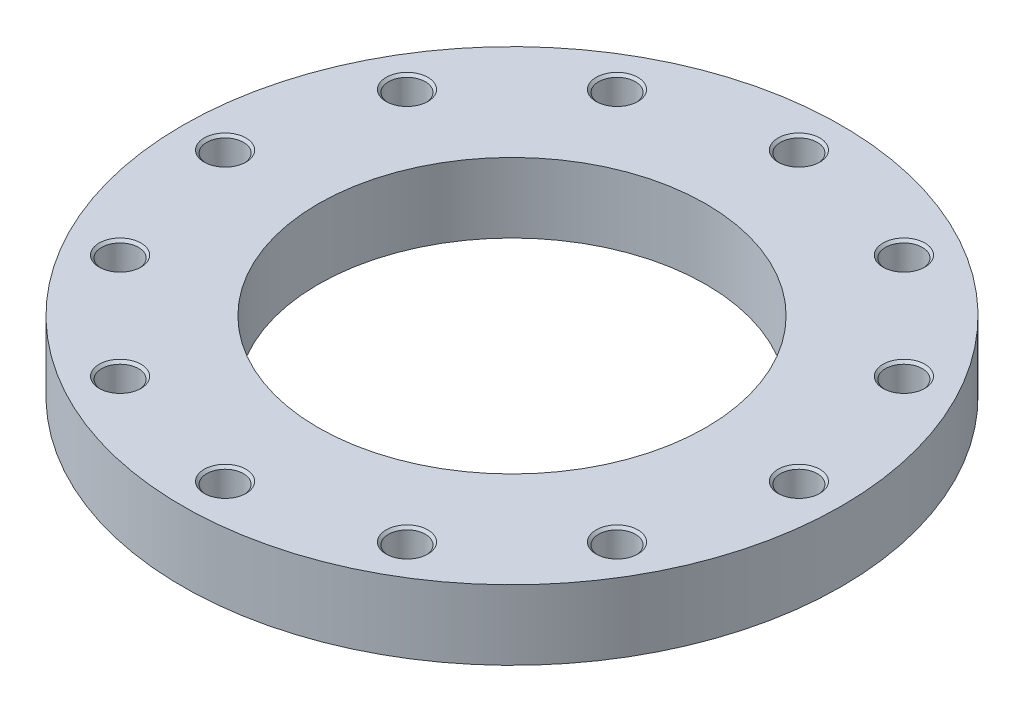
ISO-10303-21;
HEADER;
FILE_DESCRIPTION(('STEP AP214'),'2;1');
FILE_NAME('part.step','',(''),(''),'','','');
FILE_SCHEMA(('AUTOMOTIVE_DESIGN { 1 0 10303 214 1 1 1 1 }'));
ENDSEC;
DATA;
#1=APPLICATION_CONTEXT('core data for automotive mechanical design processes');
#2=APPLICATION_PROTOCOL_DEFINITION('international standard','automotive_design',2000,#1);
#3=PRODUCT_CONTEXT('',#1,'mechanical');
#4=PRODUCT('Part','Part','',(#3));
#5=PRODUCT_RELATED_PRODUCT_CATEGORY('part','',(#4));
#6=PRODUCT_DEFINITION_FORMATION('','',#4);
#7=PRODUCT_DEFINITION_CONTEXT('part definition',#1,'design');
#8=PRODUCT_DEFINITION('design','',#6,#7);
#9=PRODUCT_DEFINITION_SHAPE('','',#8);
#10=(LENGTH_UNIT() NAMED_UNIT(*) SI_UNIT(.MILLI.,.METRE.));
#11=(NAMED_UNIT(*) PLANE_ANGLE_UNIT() SI_UNIT($,.RADIAN.));
#12=(NAMED_UNIT(*) SI_UNIT($,.STERADIAN.) SOLID_ANGLE_UNIT());
#13=UNCERTAINTY_MEASURE_WITH_UNIT(LENGTH_MEASURE(1.E-05),#10,'distance_accuracy_value','');
#14=(GEOMETRIC_REPRESENTATION_CONTEXT(3) GLOBAL_UNCERTAINTY_ASSIGNED_CONTEXT((#13)) GLOBAL_UNIT_ASSIGNED_CONTEXT((#10,
#11,#12)) REPRESENTATION_CONTEXT('',''));
#15=CARTESIAN_POINT('',(0.,0.,0.));
#16=DIRECTION('',(0.,0.,1.));
#17=DIRECTION('',(1.,0.,0.));
#18=AXIS2_PLACEMENT_3D('',#15,#16,#17);
#19=CARTESIAN_POINT('',(0.,22.5,0.));
#20=DIRECTION('',(0.,-1.,0.));
#21=DIRECTION('',(1.,0.,0.));
#22=AXIS2_PLACEMENT_3D('',#19,#20,#21);
#23=CYLINDRICAL_SURFACE('',#22,212.5);
#24=CARTESIAN_POINT('',(0.,0.,0.));
#25=DIRECTION('',(0.,1.,0.));
#26=DIRECTION('',(1.,0.,0.));
#27=AXIS2_PLACEMENT_3D('',#24,#25,#26);
#28=CIRCLE('',#27,212.5);
#29=CARTESIAN_POINT('',(212.5,0.,0.));
#30=VERTEX_POINT('',#29);
#31=EDGE_CURVE('E9',#30,#30,#28,.T.);
#32=ORIENTED_EDGE('',*,*,#31,.T.);
#33=EDGE_LOOP('',(#32));
#34=FACE_BOUND('',#33,.T.);
#35=CARTESIAN_POINT('',(0.,45.,0.));
#36=DIRECTION('',(0.,1.,0.));
#37=DIRECTION('',(1.,0.,0.));
#38=AXIS2_PLACEMENT_3D('',#35,#36,#37);
#39=CIRCLE('',#38,212.5);
#40=CARTESIAN_POINT('',(212.5,45.,0.));
#41=VERTEX_POINT('',#40);
#42=EDGE_CURVE('E291',#41,#41,#39,.T.);
#43=ORIENTED_EDGE('',*,*,#42,.F.);
#44=EDGE_LOOP('',(#43));
#45=FACE_BOUND('',#44,.T.);
#46=ADVANCED_FACE('F15',(#34,#45),#23,.T.);
#47=CARTESIAN_POINT('',(168.75,0.,0.));
#48=DIRECTION('',(0.,-1.,0.));
#49=DIRECTION('',(-1.,0.,0.));
#50=AXIS2_PLACEMENT_3D('',#47,#48,#49);
#51=PLANE('',#50);
#52=CARTESIAN_POINT('',(0.,0.,0.));
#53=DIRECTION('',(0.,1.,0.));
#54=DIRECTION('',(1.,0.,0.));
#55=AXIS2_PLACEMENT_3D('',#52,#53,#54);
#56=CIRCLE('',#55,125.);
#57=CARTESIAN_POINT('',(125.,0.,0.));
#58=VERTEX_POINT('',#57);
#59=EDGE_CURVE('E25',#58,#58,#56,.T.);
#60=ORIENTED_EDGE('',*,*,#59,.T.);
#61=EDGE_LOOP('',(#60));
#62=FACE_BOUND('',#61,.T.);
#63=ORIENTED_EDGE('',*,*,#31,.F.);
#64=EDGE_LOOP('',(#63));
#65=FACE_BOUND('',#64,.T.);
#66=ADVANCED_FACE('F376',(#62,#65),#51,.T.);
#67=CARTESIAN_POINT('',(0.,22.5,0.));
#68=DIRECTION('',(0.,-1.,0.));
#69=DIRECTION('',(1.,0.,0.));
#70=AXIS2_PLACEMENT_3D('',#67,#68,#69);
#71=CYLINDRICAL_SURFACE('',#70,125.);
#72=CARTESIAN_POINT('',(0.,45.,0.));
#73=DIRECTION('',(0.,1.,0.));
#74=DIRECTION('',(1.,0.,0.));
#75=AXIS2_PLACEMENT_3D('',#72,#73,#74);
#76=CIRCLE('',#75,125.);
#77=CARTESIAN_POINT('',(125.,45.,0.));
#78=VERTEX_POINT('',#77);
#79=EDGE_CURVE('E19',#78,#78,#76,.T.);
#80=ORIENTED_EDGE('',*,*,#79,.T.);
#81=EDGE_LOOP('',(#80));
#82=FACE_BOUND('',#81,.T.);
#83=ORIENTED_EDGE('',*,*,#59,.F.);
#84=EDGE_LOOP('',(#83));
#85=FACE_BOUND('',#84,.T.);
#86=ADVANCED_FACE('F17',(#82,#85),#71,.F.);
#87=CARTESIAN_POINT('',(168.75,45.,0.));
#88=DIRECTION('',(0.,1.,0.));
#89=DIRECTION('',(1.,0.,0.));
#90=AXIS2_PLACEMENT_3D('',#87,#88,#89);
#91=PLANE('',#90);
#92=ORIENTED_EDGE('',*,*,#42,.T.);
#93=EDGE_LOOP('',(#92));
#94=FACE_BOUND('',#93,.T.);
#95=ORIENTED_EDGE('',*,*,#79,.F.);
#96=EDGE_LOOP('',(#95));
#97=FACE_BOUND('',#96,.T.);
#98=CARTESIAN_POINT('',(185.,45.,0.));
#99=DIRECTION('',(0.,-1.,0.));
#100=DIRECTION('',(1.,0.,0.));
#101=AXIS2_PLACEMENT_3D('',#98,#99,#100);
#102=CIRCLE('',#101,13.5);
#103=CARTESIAN_POINT('',(198.5,45.,0.));
#104=VERTEX_POINT('',#103);
#105=EDGE_CURVE('E351',#104,#104,#102,.T.);
#106=ORIENTED_EDGE('',*,*,#105,.T.);
#107=EDGE_LOOP('',(#106));
#108=FACE_BOUND('',#107,.T.);
#109=CARTESIAN_POINT('',(160.214699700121,45.,-92.5));
#110=DIRECTION('',(0.,-1.,0.));
#111=DIRECTION('',(0.866025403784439,0.,-0.5));
#112=AXIS2_PLACEMENT_3D('',#109,#110,#111);
#113=CIRCLE('',#112,13.5);
#114=CARTESIAN_POINT('',(171.906042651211,45.,-99.25));
#115=VERTEX_POINT('',#114);
#116=EDGE_CURVE('E346',#115,#115,#113,.T.);
#117=ORIENTED_EDGE('',*,*,#116,.T.);
#118=EDGE_LOOP('',(#117));
#119=FACE_BOUND('',#118,.T.);
#120=CARTESIAN_POINT('',(92.5,45.,-160.214699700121));
#121=DIRECTION('',(0.,-1.,0.));
#122=DIRECTION('',(0.5,0.,-0.866025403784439));
#123=AXIS2_PLACEMENT_3D('',#120,#121,#122);
#124=CIRCLE('',#123,13.5);
#125=CARTESIAN_POINT('',(99.25,45.,-171.906042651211));
#126=VERTEX_POINT('',#125);
#127=EDGE_CURVE('E332',#126,#126,#124,.T.);
#128=ORIENTED_EDGE('',*,*,#127,.T.);
#129=EDGE_LOOP('',(#128));
#130=FACE_BOUND('',#129,.T.);
#131=CARTESIAN_POINT('',(0.,45.,-185.));
#132=DIRECTION('',(0.,-1.,0.));
#133=DIRECTION('',(0.,0.,-1.));
#134=AXIS2_PLACEMENT_3D('',#131,#132,#133);
#135=CIRCLE('',#134,13.5);
#136=CARTESIAN_POINT('',(0.,45.,-198.5));
#137=VERTEX_POINT('',#136);
#138=EDGE_CURVE('E320',#137,#137,#135,.T.);
#139=ORIENTED_EDGE('',*,*,#138,.T.);
#140=EDGE_LOOP('',(#139));
#141=FACE_BOUND('',#140,.T.);
#142=CARTESIAN_POINT('',(-92.5,45.,-160.214699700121));
#143=DIRECTION('',(0.,-1.,0.));
#144=DIRECTION('',(-0.5,0.,-0.866025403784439));
#145=AXIS2_PLACEMENT_3D('',#142,#143,#144);
#146=CIRCLE('',#145,13.5);
#147=CARTESIAN_POINT('',(-99.25,45.,-171.906042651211));
#148=VERTEX_POINT('',#147);
#149=EDGE_CURVE('E310',#148,#148,#146,.T.);
#150=ORIENTED_EDGE('',*,*,#149,.T.);
#151=EDGE_LOOP('',(#150));
#152=FACE_BOUND('',#151,.T.);
#153=CARTESIAN_POINT('',(-160.214699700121,45.,-92.5));
#154=DIRECTION('',(0.,-1.,0.));
#155=DIRECTION('',(-0.866025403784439,0.,-0.5));
#156=AXIS2_PLACEMENT_3D('',#153,#154,#155);
#157=CIRCLE('',#156,13.5);
#158=CARTESIAN_POINT('',(-171.906042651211,45.,-99.25));
#159=VERTEX_POINT('',#158);
#160=EDGE_CURVE('E1144',#159,#159,#157,.T.);
#161=ORIENTED_EDGE('',*,*,#160,.T.);
#162=EDGE_LOOP('',(#161));
#163=FACE_BOUND('',#162,.T.);
#164=CARTESIAN_POINT('',(-185.,45.,0.));
#165=DIRECTION('',(0.,-1.,0.));
#166=DIRECTION('',(-1.,0.,0.));
#167=AXIS2_PLACEMENT_3D('',#164,#165,#166);
#168=CIRCLE('',#167,13.5);
#169=CARTESIAN_POINT('',(-198.5,45.,0.));
#170=VERTEX_POINT('',#169);
#171=EDGE_CURVE('E1078',#170,#170,#168,.T.);
#172=ORIENTED_EDGE('',*,*,#171,.T.);
#173=EDGE_LOOP('',(#172));
#174=FACE_BOUND('',#173,.T.);
#175=CARTESIAN_POINT('',(-160.214699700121,45.,92.5));
#176=DIRECTION('',(0.,-1.,0.));
#177=DIRECTION('',(-0.866025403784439,0.,0.5));
#178=AXIS2_PLACEMENT_3D('',#175,#176,#177);
#179=CIRCLE('',#178,13.5);
#180=CARTESIAN_POINT('',(-171.906042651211,45.,99.25));
#181=VERTEX_POINT('',#180);
#182=EDGE_CURVE('E1129',#181,#181,#179,.T.);
#183=ORIENTED_EDGE('',*,*,#182,.T.);
#184=EDGE_LOOP('',(#183));
#185=FACE_BOUND('',#184,.T.);
#186=CARTESIAN_POINT('',(-92.5,45.,160.214699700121));
#187=DIRECTION('',(0.,-1.,0.));
#188=DIRECTION('',(-0.5,0.,0.866025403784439));
#189=AXIS2_PLACEMENT_3D('',#186,#187,#188);
#190=CIRCLE('',#189,13.5);
#191=CARTESIAN_POINT('',(-99.25,45.,171.906042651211));
#192=VERTEX_POINT('',#191);
#193=EDGE_CURVE('E1117',#192,#192,#190,.T.);
#194=ORIENTED_EDGE('',*,*,#193,.T.);
#195=EDGE_LOOP('',(#194));
#196=FACE_BOUND('',#195,.T.);
#197=CARTESIAN_POINT('',(0.,45.,185.));
#198=DIRECTION('',(0.,-1.,0.));
#199=DIRECTION('',(0.,0.,1.));
#200=AXIS2_PLACEMENT_3D('',#197,#198,#199);
#201=CIRCLE('',#200,13.5);
#202=CARTESIAN_POINT('',(0.,45.,198.5));
#203=VERTEX_POINT('',#202);
#204=EDGE_CURVE('E1074',#203,#203,#201,.T.);
#205=ORIENTED_EDGE('',*,*,#204,.T.);
#206=EDGE_LOOP('',(#205));
#207=FACE_BOUND('',#206,.T.);
#208=CARTESIAN_POINT('',(92.5,45.,160.214699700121));
#209=DIRECTION('',(0.,-1.,0.));
#210=DIRECTION('',(0.5,0.,0.866025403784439));
#211=AXIS2_PLACEMENT_3D('',#208,#209,#210);
#212=CIRCLE('',#211,13.5);
#213=CARTESIAN_POINT('',(99.25,45.,171.906042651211));
#214=VERTEX_POINT('',#213);
#215=EDGE_CURVE('E1087',#214,#214,#212,.T.);
#216=ORIENTED_EDGE('',*,*,#215,.T.);
#217=EDGE_LOOP('',(#216));
#218=FACE_BOUND('',#217,.T.);
#219=CARTESIAN_POINT('',(160.214699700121,45.,92.5));
#220=DIRECTION('',(0.,-1.,0.));
#221=DIRECTION('',(0.866025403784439,0.,0.5));
#222=AXIS2_PLACEMENT_3D('',#219,#220,#221);
#223=CIRCLE('',#222,13.5);
#224=CARTESIAN_POINT('',(171.906042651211,45.,99.25));
#225=VERTEX_POINT('',#224);
#226=EDGE_CURVE('E1065',#225,#225,#223,.T.);
#227=ORIENTED_EDGE('',*,*,#226,.T.);
#228=EDGE_LOOP('',(#227));
#229=FACE_BOUND('',#228,.T.);
#230=ADVANCED_FACE('F292',(#94,#97,#108,#119,#130,#141,#152,#163,#174,#185,#196,#207,#218,#229),
#91,.T.);
#231=CARTESIAN_POINT('',(185.,5.57162193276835,0.));
#232=DIRECTION('',(0.,1.,0.));
#233=DIRECTION('',(1.,0.,0.));
#234=AXIS2_PLACEMENT_3D('',#231,#232,#233);
#235=CONICAL_SURFACE('',#234,5.938125,1.0471975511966);
#236=CARTESIAN_POINT('',(185.,9.,0.));
#237=DIRECTION('',(0.,-1.,0.));
#238=DIRECTION('',(1.,0.,0.));
#239=AXIS2_PLACEMENT_3D('',#236,#237,#238);
#240=CIRCLE('',#239,11.87625);
#241=CARTESIAN_POINT('',(196.87625,9.,0.));
#242=VERTEX_POINT('',#241);
#243=EDGE_CURVE('E297',#242,#242,#240,.T.);
#244=ORIENTED_EDGE('',*,*,#243,.F.);
#245=EDGE_LOOP('',(#244));
#246=FACE_BOUND('',#245,.T.);
#247=CARTESIAN_POINT('',(185.,2.1432438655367,0.));
#248=VERTEX_POINT('',#247);
#249=VERTEX_LOOP('',#248);
#250=FACE_BOUND('',#249,.T.);
#251=ADVANCED_FACE('F363',(#246,#250),#235,.F.);
#252=CARTESIAN_POINT('',(185.,13.688125,0.));
#253=DIRECTION('',(0.,1.,0.));
#254=DIRECTION('',(1.,0.,0.));
#255=AXIS2_PLACEMENT_3D('',#252,#253,#254);
#256=CYLINDRICAL_SURFACE('',#255,11.87625);
#257=CARTESIAN_POINT('',(185.,18.37625,0.));
#258=DIRECTION('',(0.,-1.,0.));
#259=DIRECTION('',(1.,0.,0.));
#260=AXIS2_PLACEMENT_3D('',#257,#258,#259);
#261=CIRCLE('',#260,11.87625);
#262=CARTESIAN_POINT('',(196.87625,18.37625,0.));
#263=VERTEX_POINT('',#262);
#264=EDGE_CURVE('E334',#263,#263,#261,.T.);
#265=ORIENTED_EDGE('',*,*,#264,.F.);
#266=EDGE_LOOP('',(#265));
#267=FACE_BOUND('',#266,.T.);
#268=ORIENTED_EDGE('',*,*,#243,.T.);
#269=EDGE_LOOP('',(#268));
#270=FACE_BOUND('',#269,.T.);
#271=ADVANCED_FACE('F360',(#267,#270),#256,.F.);
#272=CARTESIAN_POINT('',(185.,19.188125,0.));
#273=DIRECTION('',(0.,1.,0.));
#274=DIRECTION('',(1.,0.,0.));
#275=AXIS2_PLACEMENT_3D('',#272,#273,#274);
#276=CONICAL_SURFACE('',#275,12.688125,0.785398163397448);
#277=CARTESIAN_POINT('',(185.,20.,0.));
#278=DIRECTION('',(0.,-1.,0.));
#279=DIRECTION('',(1.,0.,0.));
#280=AXIS2_PLACEMENT_3D('',#277,#278,#279);
#281=CIRCLE('',#280,13.5);
#282=CARTESIAN_POINT('',(198.5,20.,0.));
#283=VERTEX_POINT('',#282);
#284=EDGE_CURVE('E355',#283,#283,#281,.T.);
#285=ORIENTED_EDGE('',*,*,#284,.F.);
#286=EDGE_LOOP('',(#285));
#287=FACE_BOUND('',#286,.T.);
#288=ORIENTED_EDGE('',*,*,#264,.T.);
#289=EDGE_LOOP('',(#288));
#290=FACE_BOUND('',#289,.T.);
#291=ADVANCED_FACE('F358',(#287,#290),#276,.F.);
#292=CARTESIAN_POINT('',(197.688125,20.,0.));
#293=DIRECTION('',(0.,1.,0.));
#294=DIRECTION('',(-1.,0.,0.));
#295=AXIS2_PLACEMENT_3D('',#292,#293,#294);
#296=PLANE('',#295);
#297=CARTESIAN_POINT('',(185.,20.,0.));
#298=DIRECTION('',(0.,-1.,0.));
#299=DIRECTION('',(1.,0.,0.));
#300=AXIS2_PLACEMENT_3D('',#297,#298,#299);
#301=CIRCLE('',#300,11.87625);
#302=CARTESIAN_POINT('',(196.87625,20.,0.));
#303=VERTEX_POINT('',#302);
#304=EDGE_CURVE('E353',#303,#303,#301,.T.);
#305=ORIENTED_EDGE('',*,*,#304,.F.);
#306=EDGE_LOOP('',(#305));
#307=FACE_BOUND('',#306,.T.);
#308=ORIENTED_EDGE('',*,*,#284,.T.);
#309=EDGE_LOOP('',(#308));
#310=FACE_BOUND('',#309,.T.);
#311=ADVANCED_FACE('F493',(#307,#310),#296,.F.);
#312=CARTESIAN_POINT('',(185.,31.688125,0.));
#313=DIRECTION('',(0.,1.,0.));
#314=DIRECTION('',(1.,0.,0.));
#315=AXIS2_PLACEMENT_3D('',#312,#313,#314);
#316=CYLINDRICAL_SURFACE('',#315,11.87625);
#317=CARTESIAN_POINT('',(185.,43.37625,0.));
#318=DIRECTION('',(0.,-1.,0.));
#319=DIRECTION('',(1.,0.,0.));
#320=AXIS2_PLACEMENT_3D('',#317,#318,#319);
#321=CIRCLE('',#320,11.87625);
#322=CARTESIAN_POINT('',(196.87625,43.37625,0.));
#323=VERTEX_POINT('',#322);
#324=EDGE_CURVE('E349',#323,#323,#321,.T.);
#325=ORIENTED_EDGE('',*,*,#324,.F.);
#326=EDGE_LOOP('',(#325));
#327=FACE_BOUND('',#326,.T.);
#328=ORIENTED_EDGE('',*,*,#304,.T.);
#329=EDGE_LOOP('',(#328));
#330=FACE_BOUND('',#329,.T.);
#331=ADVANCED_FACE('F655',(#327,#330),#316,.F.);
#332=CARTESIAN_POINT('',(185.,44.188125,0.));
#333=DIRECTION('',(0.,1.,0.));
#334=DIRECTION('',(1.,0.,0.));
#335=AXIS2_PLACEMENT_3D('',#332,#333,#334);
#336=CONICAL_SURFACE('',#335,12.688125,0.785398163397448);
#337=ORIENTED_EDGE('',*,*,#105,.F.);
#338=EDGE_LOOP('',(#337));
#339=FACE_BOUND('',#338,.T.);
#340=ORIENTED_EDGE('',*,*,#324,.T.);
#341=EDGE_LOOP('',(#340));
#342=FACE_BOUND('',#341,.T.);
#343=ADVANCED_FACE('F651',(#339,#342),#336,.F.);
#344=CARTESIAN_POINT('',(160.214699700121,5.57162193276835,-92.5));
#345=DIRECTION('',(0.,1.,0.));
#346=DIRECTION('',(0.866025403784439,0.,-0.5));
#347=AXIS2_PLACEMENT_3D('',#344,#345,#346);
#348=CONICAL_SURFACE('',#347,5.938125,1.0471975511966);
#349=CARTESIAN_POINT('',(160.214699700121,9.,-92.5));
#350=DIRECTION('',(0.,-1.,0.));
#351=DIRECTION('',(0.866025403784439,0.,-0.5));
#352=AXIS2_PLACEMENT_3D('',#349,#350,#351);
#353=CIRCLE('',#352,11.87625);
#354=CARTESIAN_POINT('',(170.499833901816,9.,-98.438125));
#355=VERTEX_POINT('',#354);
#356=EDGE_CURVE('E352',#355,#355,#353,.T.);
#357=ORIENTED_EDGE('',*,*,#356,.F.);
#358=EDGE_LOOP('',(#357));
#359=FACE_BOUND('',#358,.T.);
#360=CARTESIAN_POINT('',(160.214699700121,2.1432438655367,-92.5));
#361=VERTEX_POINT('',#360);
#362=VERTEX_LOOP('',#361);
#363=FACE_BOUND('',#362,.T.);
#364=ADVANCED_FACE('F647',(#359,#363),#348,.F.);
#365=CARTESIAN_POINT('',(160.214699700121,13.688125,-92.5));
#366=DIRECTION('',(0.,1.,0.));
#367=DIRECTION('',(0.866025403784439,0.,-0.5));
#368=AXIS2_PLACEMENT_3D('',#365,#366,#367);
#369=CYLINDRICAL_SURFACE('',#368,11.87625);
#370=CARTESIAN_POINT('',(160.214699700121,18.37625,-92.5));
#371=DIRECTION('',(0.,-1.,0.));
#372=DIRECTION('',(0.866025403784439,0.,-0.5));
#373=AXIS2_PLACEMENT_3D('',#370,#371,#372);
#374=CIRCLE('',#373,11.87625);
#375=CARTESIAN_POINT('',(170.499833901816,18.37625,-98.438125));
#376=VERTEX_POINT('',#375);
#377=EDGE_CURVE('E348',#376,#376,#374,.T.);
#378=ORIENTED_EDGE('',*,*,#377,.F.);
#379=EDGE_LOOP('',(#378));
#380=FACE_BOUND('',#379,.T.);
#381=ORIENTED_EDGE('',*,*,#356,.T.);
#382=EDGE_LOOP('',(#381));
#383=FACE_BOUND('',#382,.T.);
#384=ADVANCED_FACE('F445',(#380,#383),#369,.F.);
#385=CARTESIAN_POINT('',(160.214699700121,19.188125,-92.5));
#386=DIRECTION('',(0.,1.,0.));
#387=DIRECTION('',(0.866025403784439,0.,-0.5));
#388=AXIS2_PLACEMENT_3D('',#385,#386,#387);
#389=CONICAL_SURFACE('',#388,12.688125,0.785398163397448);
#390=CARTESIAN_POINT('',(160.214699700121,20.,-92.5));
#391=DIRECTION('',(0.,-1.,0.));
#392=DIRECTION('',(0.866025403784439,0.,-0.5));
#393=AXIS2_PLACEMENT_3D('',#390,#391,#392);
#394=CIRCLE('',#393,13.5);
#395=CARTESIAN_POINT('',(171.906042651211,20.,-99.25));
#396=VERTEX_POINT('',#395);
#397=EDGE_CURVE('E345',#396,#396,#394,.T.);
#398=ORIENTED_EDGE('',*,*,#397,.F.);
#399=EDGE_LOOP('',(#398));
#400=FACE_BOUND('',#399,.T.);
#401=ORIENTED_EDGE('',*,*,#377,.T.);
#402=EDGE_LOOP('',(#401));
#403=FACE_BOUND('',#402,.T.);
#404=ADVANCED_FACE('F441',(#400,#403),#389,.F.);
#405=CARTESIAN_POINT('',(171.202938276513,20.,-98.8440625));
#406=DIRECTION('',(0.,1.,0.));
#407=DIRECTION('',(-0.866025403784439,0.,0.5));
#408=AXIS2_PLACEMENT_3D('',#405,#406,#407);
#409=PLANE('',#408);
#410=CARTESIAN_POINT('',(160.214699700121,20.,-92.5));
#411=DIRECTION('',(0.,-1.,0.));
#412=DIRECTION('',(0.866025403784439,0.,-0.5));
#413=AXIS2_PLACEMENT_3D('',#410,#411,#412);
#414=CIRCLE('',#413,11.87625);
#415=CARTESIAN_POINT('',(170.499833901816,20.,-98.438125));
#416=VERTEX_POINT('',#415);
#417=EDGE_CURVE('E343',#416,#416,#414,.T.);
#418=ORIENTED_EDGE('',*,*,#417,.F.);
#419=EDGE_LOOP('',(#418));
#420=FACE_BOUND('',#419,.T.);
#421=ORIENTED_EDGE('',*,*,#397,.T.);
#422=EDGE_LOOP('',(#421));
#423=FACE_BOUND('',#422,.T.);
#424=ADVANCED_FACE('F444',(#420,#423),#409,.F.);
#425=CARTESIAN_POINT('',(160.214699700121,31.688125,-92.5));
#426=DIRECTION('',(0.,1.,0.));
#427=DIRECTION('',(0.866025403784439,0.,-0.5));
#428=AXIS2_PLACEMENT_3D('',#425,#426,#427);
#429=CYLINDRICAL_SURFACE('',#428,11.87625);
#430=CARTESIAN_POINT('',(160.214699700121,43.37625,-92.5));
#431=DIRECTION('',(0.,-1.,0.));
#432=DIRECTION('',(0.866025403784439,0.,-0.5));
#433=AXIS2_PLACEMENT_3D('',#430,#431,#432);
#434=CIRCLE('',#433,11.87625);
#435=CARTESIAN_POINT('',(170.499833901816,43.37625,-98.438125));
#436=VERTEX_POINT('',#435);
#437=EDGE_CURVE('E342',#436,#436,#434,.T.);
#438=ORIENTED_EDGE('',*,*,#437,.F.);
#439=EDGE_LOOP('',(#438));
#440=FACE_BOUND('',#439,.T.);
#441=ORIENTED_EDGE('',*,*,#417,.T.);
#442=EDGE_LOOP('',(#441));
#443=FACE_BOUND('',#442,.T.);
#444=ADVANCED_FACE('F637',(#440,#443),#429,.F.);
#445=CARTESIAN_POINT('',(160.214699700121,44.188125,-92.5));
#446=DIRECTION('',(0.,1.,0.));
#447=DIRECTION('',(0.866025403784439,0.,-0.5));
#448=AXIS2_PLACEMENT_3D('',#445,#446,#447);
#449=CONICAL_SURFACE('',#448,12.688125,0.785398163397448);
#450=ORIENTED_EDGE('',*,*,#116,.F.);
#451=EDGE_LOOP('',(#450));
#452=FACE_BOUND('',#451,.T.);
#453=ORIENTED_EDGE('',*,*,#437,.T.);
#454=EDGE_LOOP('',(#453));
#455=FACE_BOUND('',#454,.T.);
#456=ADVANCED_FACE('F503',(#452,#455),#449,.F.);
#457=CARTESIAN_POINT('',(92.5,5.57162193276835,-160.214699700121));
#458=DIRECTION('',(0.,1.,0.));
#459=DIRECTION('',(0.5,0.,-0.866025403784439));
#460=AXIS2_PLACEMENT_3D('',#457,#458,#459);
#461=CONICAL_SURFACE('',#460,5.938125,1.0471975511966);
#462=CARTESIAN_POINT('',(92.5,9.,-160.214699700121));
#463=DIRECTION('',(0.,-1.,0.));
#464=DIRECTION('',(0.5,0.,-0.866025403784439));
#465=AXIS2_PLACEMENT_3D('',#462,#463,#464);
#466=CIRCLE('',#465,11.87625);
#467=CARTESIAN_POINT('',(98.438125,9.,-170.499833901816));
#468=VERTEX_POINT('',#467);
#469=EDGE_CURVE('E340',#468,#468,#466,.T.);
#470=ORIENTED_EDGE('',*,*,#469,.F.);
#471=EDGE_LOOP('',(#470));
#472=FACE_BOUND('',#471,.T.);
#473=CARTESIAN_POINT('',(92.5,2.1432438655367,-160.214699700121));
#474=VERTEX_POINT('',#473);
#475=VERTEX_LOOP('',#474);
#476=FACE_BOUND('',#475,.T.);
#477=ADVANCED_FACE('F499',(#472,#476),#461,.F.);
#478=CARTESIAN_POINT('',(92.5,13.688125,-160.214699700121));
#479=DIRECTION('',(0.,1.,0.));
#480=DIRECTION('',(0.5,0.,-0.866025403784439));
#481=AXIS2_PLACEMENT_3D('',#478,#479,#480);
#482=CYLINDRICAL_SURFACE('',#481,11.87625);
#483=CARTESIAN_POINT('',(92.5,18.37625,-160.214699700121));
#484=DIRECTION('',(0.,-1.,0.));
#485=DIRECTION('',(0.5,0.,-0.866025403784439));
#486=AXIS2_PLACEMENT_3D('',#483,#484,#485);
#487=CIRCLE('',#486,11.87625);
#488=CARTESIAN_POINT('',(98.438125,18.37625,-170.499833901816));
#489=VERTEX_POINT('',#488);
#490=EDGE_CURVE('E339',#489,#489,#487,.T.);
#491=ORIENTED_EDGE('',*,*,#490,.F.);
#492=EDGE_LOOP('',(#491));
#493=FACE_BOUND('',#492,.T.);
#494=ORIENTED_EDGE('',*,*,#469,.T.);
#495=EDGE_LOOP('',(#494));
#496=FACE_BOUND('',#495,.T.);
#497=ADVANCED_FACE('F502',(#493,#496),#482,.F.);
#498=CARTESIAN_POINT('',(92.5,19.188125,-160.214699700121));
#499=DIRECTION('',(0.,1.,0.));
#500=DIRECTION('',(0.5,0.,-0.866025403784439));
#501=AXIS2_PLACEMENT_3D('',#498,#499,#500);
#502=CONICAL_SURFACE('',#501,12.688125,0.785398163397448);
#503=CARTESIAN_POINT('',(92.5,20.,-160.214699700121));
#504=DIRECTION('',(0.,-1.,0.));
#505=DIRECTION('',(0.5,0.,-0.866025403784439));
#506=AXIS2_PLACEMENT_3D('',#503,#504,#505);
#507=CIRCLE('',#506,13.5);
#508=CARTESIAN_POINT('',(99.25,20.,-171.906042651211));
#509=VERTEX_POINT('',#508);
#510=EDGE_CURVE('E337',#509,#509,#507,.T.);
#511=ORIENTED_EDGE('',*,*,#510,.F.);
#512=EDGE_LOOP('',(#511));
#513=FACE_BOUND('',#512,.T.);
#514=ORIENTED_EDGE('',*,*,#490,.T.);
#515=EDGE_LOOP('',(#514));
#516=FACE_BOUND('',#515,.T.);
#517=ADVANCED_FACE('F628',(#513,#516),#502,.F.);
#518=CARTESIAN_POINT('',(98.8440625,20.,-171.202938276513));
#519=DIRECTION('',(0.,1.,0.));
#520=DIRECTION('',(-0.5,0.,0.866025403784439));
#521=AXIS2_PLACEMENT_3D('',#518,#519,#520);
#522=PLANE('',#521);
#523=CARTESIAN_POINT('',(92.5,20.,-160.214699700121));
#524=DIRECTION('',(0.,-1.,0.));
#525=DIRECTION('',(0.5,0.,-0.866025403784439));
#526=AXIS2_PLACEMENT_3D('',#523,#524,#525);
#527=CIRCLE('',#526,11.87625);
#528=CARTESIAN_POINT('',(98.438125,20.,-170.499833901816));
#529=VERTEX_POINT('',#528);
#530=EDGE_CURVE('E336',#529,#529,#527,.T.);
#531=ORIENTED_EDGE('',*,*,#530,.F.);
#532=EDGE_LOOP('',(#531));
#533=FACE_BOUND('',#532,.T.);
#534=ORIENTED_EDGE('',*,*,#510,.T.);
#535=EDGE_LOOP('',(#534));
#536=FACE_BOUND('',#535,.T.);
#537=ADVANCED_FACE('F626',(#533,#536),#522,.F.);
#538=CARTESIAN_POINT('',(92.5,31.688125,-160.214699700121));
#539=DIRECTION('',(0.,1.,0.));
#540=DIRECTION('',(0.5,0.,-0.866025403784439));
#541=AXIS2_PLACEMENT_3D('',#538,#539,#540);
#542=CYLINDRICAL_SURFACE('',#541,11.87625);
#543=CARTESIAN_POINT('',(92.5,43.37625,-160.214699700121));
#544=DIRECTION('',(0.,-1.,0.));
#545=DIRECTION('',(0.5,0.,-0.866025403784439));
#546=AXIS2_PLACEMENT_3D('',#543,#544,#545);
#547=CIRCLE('',#546,11.87625);
#548=CARTESIAN_POINT('',(98.438125,43.37625,-170.499833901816));
#549=VERTEX_POINT('',#548);
#550=EDGE_CURVE('E330',#549,#549,#547,.T.);
#551=ORIENTED_EDGE('',*,*,#550,.F.);
#552=EDGE_LOOP('',(#551));
#553=FACE_BOUND('',#552,.T.);
#554=ORIENTED_EDGE('',*,*,#530,.T.);
#555=EDGE_LOOP('',(#554));
#556=FACE_BOUND('',#555,.T.);
#557=ADVANCED_FACE('F620',(#553,#556),#542,.F.);
#558=CARTESIAN_POINT('',(92.5,44.188125,-160.214699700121));
#559=DIRECTION('',(0.,1.,0.));
#560=DIRECTION('',(0.5,0.,-0.866025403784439));
#561=AXIS2_PLACEMENT_3D('',#558,#559,#560);
#562=CONICAL_SURFACE('',#561,12.688125,0.785398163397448);
#563=ORIENTED_EDGE('',*,*,#127,.F.);
#564=EDGE_LOOP('',(#563));
#565=FACE_BOUND('',#564,.T.);
#566=ORIENTED_EDGE('',*,*,#550,.T.);
#567=EDGE_LOOP('',(#566));
#568=FACE_BOUND('',#567,.T.);
#569=ADVANCED_FACE('F610',(#565,#568),#562,.F.);
#570=CARTESIAN_POINT('',(0.,5.57162193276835,-185.));
#571=DIRECTION('',(0.,1.,0.));
#572=DIRECTION('',(0.,0.,-1.));
#573=AXIS2_PLACEMENT_3D('',#570,#571,#572);
#574=CONICAL_SURFACE('',#573,5.938125,1.0471975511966);
#575=CARTESIAN_POINT('',(0.,9.,-185.));
#576=DIRECTION('',(0.,-1.,0.));
#577=DIRECTION('',(0.,0.,-1.));
#578=AXIS2_PLACEMENT_3D('',#575,#576,#577);
#579=CIRCLE('',#578,11.87625);
#580=CARTESIAN_POINT('',(0.,9.,-196.87625));
#581=VERTEX_POINT('',#580);
#582=EDGE_CURVE('E328',#581,#581,#579,.T.);
#583=ORIENTED_EDGE('',*,*,#582,.F.);
#584=EDGE_LOOP('',(#583));
#585=FACE_BOUND('',#584,.T.);
#586=CARTESIAN_POINT('',(0.,2.1432438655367,-185.));
#587=VERTEX_POINT('',#586);
#588=VERTEX_LOOP('',#587);
#589=FACE_BOUND('',#588,.T.);
#590=ADVANCED_FACE('F605',(#585,#589),#574,.F.);
#591=CARTESIAN_POINT('',(0.,13.688125,-185.));
#592=DIRECTION('',(0.,1.,0.));
#593=DIRECTION('',(0.,0.,-1.));
#594=AXIS2_PLACEMENT_3D('',#591,#592,#593);
#595=CYLINDRICAL_SURFACE('',#594,11.87625);
#596=CARTESIAN_POINT('',(0.,18.37625,-185.));
#597=DIRECTION('',(0.,-1.,0.));
#598=DIRECTION('',(0.,0.,-1.));
#599=AXIS2_PLACEMENT_3D('',#596,#597,#598);
#600=CIRCLE('',#599,11.87625);
#601=CARTESIAN_POINT('',(0.,18.37625,-196.87625));
#602=VERTEX_POINT('',#601);
#603=EDGE_CURVE('E326',#602,#602,#600,.T.);
#604=ORIENTED_EDGE('',*,*,#603,.F.);
#605=EDGE_LOOP('',(#604));
#606=FACE_BOUND('',#605,.T.);
#607=ORIENTED_EDGE('',*,*,#582,.T.);
#608=EDGE_LOOP('',(#607));
#609=FACE_BOUND('',#608,.T.);
#610=ADVANCED_FACE('F458',(#606,#609),#595,.F.);
#611=CARTESIAN_POINT('',(0.,19.188125,-185.));
#612=DIRECTION('',(0.,1.,0.));
#613=DIRECTION('',(0.,0.,-1.));
#614=AXIS2_PLACEMENT_3D('',#611,#612,#613);
#615=CONICAL_SURFACE('',#614,12.688125,0.785398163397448);
#616=CARTESIAN_POINT('',(0.,20.,-185.));
#617=DIRECTION('',(0.,-1.,0.));
#618=DIRECTION('',(0.,0.,-1.));
#619=AXIS2_PLACEMENT_3D('',#616,#617,#618);
#620=CIRCLE('',#619,13.5);
#621=CARTESIAN_POINT('',(0.,20.,-198.5));
#622=VERTEX_POINT('',#621);
#623=EDGE_CURVE('E324',#622,#622,#620,.T.);
#624=ORIENTED_EDGE('',*,*,#623,.F.);
#625=EDGE_LOOP('',(#624));
#626=FACE_BOUND('',#625,.T.);
#627=ORIENTED_EDGE('',*,*,#603,.T.);
#628=EDGE_LOOP('',(#627));
#629=FACE_BOUND('',#628,.T.);
#630=ADVANCED_FACE('F454',(#626,#629),#615,.F.);
#631=CARTESIAN_POINT('',(0.,20.,-197.688125));
#632=DIRECTION('',(0.,1.,0.));
#633=DIRECTION('',(0.,0.,1.));
#634=AXIS2_PLACEMENT_3D('',#631,#632,#633);
#635=PLANE('',#634);
#636=CARTESIAN_POINT('',(0.,20.,-185.));
#637=DIRECTION('',(0.,-1.,0.));
#638=DIRECTION('',(0.,0.,-1.));
#639=AXIS2_PLACEMENT_3D('',#636,#637,#638);
#640=CIRCLE('',#639,11.87625);
#641=CARTESIAN_POINT('',(0.,20.,-196.87625));
#642=VERTEX_POINT('',#641);
#643=EDGE_CURVE('E322',#642,#642,#640,.T.);
#644=ORIENTED_EDGE('',*,*,#643,.F.);
#645=EDGE_LOOP('',(#644));
#646=FACE_BOUND('',#645,.T.);
#647=ORIENTED_EDGE('',*,*,#623,.T.);
#648=EDGE_LOOP('',(#647));
#649=FACE_BOUND('',#648,.T.);
#650=ADVANCED_FACE('F457',(#646,#649),#635,.F.);
#651=CARTESIAN_POINT('',(0.,31.688125,-185.));
#652=DIRECTION('',(0.,1.,0.));
#653=DIRECTION('',(0.,0.,-1.));
#654=AXIS2_PLACEMENT_3D('',#651,#652,#653);
#655=CYLINDRICAL_SURFACE('',#654,11.87625);
#656=CARTESIAN_POINT('',(0.,43.37625,-185.));
#657=DIRECTION('',(0.,-1.,0.));
#658=DIRECTION('',(0.,0.,-1.));
#659=AXIS2_PLACEMENT_3D('',#656,#657,#658);
#660=CIRCLE('',#659,11.87625);
#661=CARTESIAN_POINT('',(0.,43.37625,-196.87625));
#662=VERTEX_POINT('',#661);
#663=EDGE_CURVE('E318',#662,#662,#660,.T.);
#664=ORIENTED_EDGE('',*,*,#663,.F.);
#665=EDGE_LOOP('',(#664));
#666=FACE_BOUND('',#665,.T.);
#667=ORIENTED_EDGE('',*,*,#643,.T.);
#668=EDGE_LOOP('',(#667));
#669=FACE_BOUND('',#668,.T.);
#670=ADVANCED_FACE('F597',(#666,#669),#655,.F.);
#671=CARTESIAN_POINT('',(0.,44.188125,-185.));
#672=DIRECTION('',(0.,1.,0.));
#673=DIRECTION('',(0.,0.,-1.));
#674=AXIS2_PLACEMENT_3D('',#671,#672,#673);
#675=CONICAL_SURFACE('',#674,12.688125,0.785398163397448);
#676=ORIENTED_EDGE('',*,*,#138,.F.);
#677=EDGE_LOOP('',(#676));
#678=FACE_BOUND('',#677,.T.);
#679=ORIENTED_EDGE('',*,*,#663,.T.);
#680=EDGE_LOOP('',(#679));
#681=FACE_BOUND('',#680,.T.);
#682=ADVANCED_FACE('F593',(#678,#681),#675,.F.);
#683=CARTESIAN_POINT('',(-92.5,5.57162193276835,-160.214699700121));
#684=DIRECTION('',(0.,1.,0.));
#685=DIRECTION('',(-0.5,0.,-0.866025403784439));
#686=AXIS2_PLACEMENT_3D('',#683,#684,#685);
#687=CONICAL_SURFACE('',#686,5.938125,1.0471975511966);
#688=CARTESIAN_POINT('',(-92.5,9.,-160.214699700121));
#689=DIRECTION('',(0.,-1.,0.));
#690=DIRECTION('',(-0.5,0.,-0.866025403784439));
#691=AXIS2_PLACEMENT_3D('',#688,#689,#690);
#692=CIRCLE('',#691,11.87625);
#693=CARTESIAN_POINT('',(-98.438125,9.,-170.499833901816));
#694=VERTEX_POINT('',#693);
#695=EDGE_CURVE('E316',#694,#694,#692,.T.);
#696=ORIENTED_EDGE('',*,*,#695,.F.);
#697=EDGE_LOOP('',(#696));
#698=FACE_BOUND('',#697,.T.);
#699=CARTESIAN_POINT('',(-92.5,2.1432438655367,-160.214699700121));
#700=VERTEX_POINT('',#699);
#701=VERTEX_LOOP('',#700);
#702=FACE_BOUND('',#701,.T.);
#703=ADVANCED_FACE('F589',(#698,#702),#687,.F.);
#704=CARTESIAN_POINT('',(-92.5,13.688125,-160.214699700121));
#705=DIRECTION('',(0.,1.,0.));
#706=DIRECTION('',(-0.5,0.,-0.866025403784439));
#707=AXIS2_PLACEMENT_3D('',#704,#705,#706);
#708=CYLINDRICAL_SURFACE('',#707,11.87625);
#709=CARTESIAN_POINT('',(-92.5,18.37625,-160.214699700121));
#710=DIRECTION('',(0.,-1.,0.));
#711=DIRECTION('',(-0.5,0.,-0.866025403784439));
#712=AXIS2_PLACEMENT_3D('',#709,#710,#711);
#713=CIRCLE('',#712,11.87625);
#714=CARTESIAN_POINT('',(-98.438125,18.37625,-170.499833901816));
#715=VERTEX_POINT('',#714);
#716=EDGE_CURVE('E314',#715,#715,#713,.T.);
#717=ORIENTED_EDGE('',*,*,#716,.F.);
#718=EDGE_LOOP('',(#717));
#719=FACE_BOUND('',#718,.T.);
#720=ORIENTED_EDGE('',*,*,#695,.T.);
#721=EDGE_LOOP('',(#720));
#722=FACE_BOUND('',#721,.T.);
#723=ADVANCED_FACE('F585',(#719,#722),#708,.F.);
#724=CARTESIAN_POINT('',(-92.5,19.188125,-160.214699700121));
#725=DIRECTION('',(0.,1.,0.));
#726=DIRECTION('',(-0.5,0.,-0.866025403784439));
#727=AXIS2_PLACEMENT_3D('',#724,#725,#726);
#728=CONICAL_SURFACE('',#727,12.688125,0.785398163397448);
#729=CARTESIAN_POINT('',(-92.5,20.,-160.214699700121));
#730=DIRECTION('',(0.,-1.,0.));
#731=DIRECTION('',(-0.5,0.,-0.866025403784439));
#732=AXIS2_PLACEMENT_3D('',#729,#730,#731);
#733=CIRCLE('',#732,13.5);
#734=CARTESIAN_POINT('',(-99.25,20.,-171.906042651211));
#735=VERTEX_POINT('',#734);
#736=EDGE_CURVE('E313',#735,#735,#733,.T.);
#737=ORIENTED_EDGE('',*,*,#736,.F.);
#738=EDGE_LOOP('',(#737));
#739=FACE_BOUND('',#738,.T.);
#740=ORIENTED_EDGE('',*,*,#716,.T.);
#741=EDGE_LOOP('',(#740));
#742=FACE_BOUND('',#741,.T.);
#743=ADVANCED_FACE('F581',(#739,#742),#728,.F.);
#744=CARTESIAN_POINT('',(-98.8440625,20.,-171.202938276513));
#745=DIRECTION('',(0.,1.,0.));
#746=DIRECTION('',(0.5,0.,0.866025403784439));
#747=AXIS2_PLACEMENT_3D('',#744,#745,#746);
#748=PLANE('',#747);
#749=CARTESIAN_POINT('',(-92.5,20.,-160.214699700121));
#750=DIRECTION('',(0.,-1.,0.));
#751=DIRECTION('',(-0.5,0.,-0.866025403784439));
#752=AXIS2_PLACEMENT_3D('',#749,#750,#751);
#753=CIRCLE('',#752,11.87625);
#754=CARTESIAN_POINT('',(-98.438125,20.,-170.499833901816));
#755=VERTEX_POINT('',#754);
#756=EDGE_CURVE('E311',#755,#755,#753,.T.);
#757=ORIENTED_EDGE('',*,*,#756,.F.);
#758=EDGE_LOOP('',(#757));
#759=FACE_BOUND('',#758,.T.);
#760=ORIENTED_EDGE('',*,*,#736,.T.);
#761=EDGE_LOOP('',(#760));
#762=FACE_BOUND('',#761,.T.);
#763=ADVANCED_FACE('F577',(#759,#762),#748,.F.);
#764=CARTESIAN_POINT('',(-92.5,31.688125,-160.214699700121));
#765=DIRECTION('',(0.,1.,0.));
#766=DIRECTION('',(-0.5,0.,-0.866025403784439));
#767=AXIS2_PLACEMENT_3D('',#764,#765,#766);
#768=CYLINDRICAL_SURFACE('',#767,11.87625);
#769=CARTESIAN_POINT('',(-92.5,43.37625,-160.214699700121));
#770=DIRECTION('',(0.,-1.,0.));
#771=DIRECTION('',(-0.5,0.,-0.866025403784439));
#772=AXIS2_PLACEMENT_3D('',#769,#770,#771);
#773=CIRCLE('',#772,11.87625);
#774=CARTESIAN_POINT('',(-98.438125,43.37625,-170.499833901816));
#775=VERTEX_POINT('',#774);
#776=EDGE_CURVE('E308',#775,#775,#773,.T.);
#777=ORIENTED_EDGE('',*,*,#776,.F.);
#778=EDGE_LOOP('',(#777));
#779=FACE_BOUND('',#778,.T.);
#780=ORIENTED_EDGE('',*,*,#756,.T.);
#781=EDGE_LOOP('',(#780));
#782=FACE_BOUND('',#781,.T.);
#783=ADVANCED_FACE('F573',(#779,#782),#768,.F.);
#784=CARTESIAN_POINT('',(-92.5,44.188125,-160.214699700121));
#785=DIRECTION('',(0.,1.,0.));
#786=DIRECTION('',(-0.5,0.,-0.866025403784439));
#787=AXIS2_PLACEMENT_3D('',#784,#785,#786);
#788=CONICAL_SURFACE('',#787,12.688125,0.785398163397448);
#789=ORIENTED_EDGE('',*,*,#149,.F.);
#790=EDGE_LOOP('',(#789));
#791=FACE_BOUND('',#790,.T.);
#792=ORIENTED_EDGE('',*,*,#776,.T.);
#793=EDGE_LOOP('',(#792));
#794=FACE_BOUND('',#793,.T.);
#795=ADVANCED_FACE('F569',(#791,#794),#788,.F.);
#796=CARTESIAN_POINT('',(-160.214699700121,5.57162193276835,-92.5));
#797=DIRECTION('',(0.,1.,0.));
#798=DIRECTION('',(-0.866025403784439,0.,-0.5));
#799=AXIS2_PLACEMENT_3D('',#796,#797,#798);
#800=CONICAL_SURFACE('',#799,5.938125,1.0471975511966);
#801=CARTESIAN_POINT('',(-160.214699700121,9.,-92.5));
#802=DIRECTION('',(0.,-1.,0.));
#803=DIRECTION('',(-0.866025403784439,0.,-0.5));
#804=AXIS2_PLACEMENT_3D('',#801,#802,#803);
#805=CIRCLE('',#804,11.87625);
#806=CARTESIAN_POINT('',(-170.499833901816,9.,-98.438125));
#807=VERTEX_POINT('',#806);
#808=EDGE_CURVE('E305',#807,#807,#805,.T.);
#809=ORIENTED_EDGE('',*,*,#808,.F.);
#810=EDGE_LOOP('',(#809));
#811=FACE_BOUND('',#810,.T.);
#812=CARTESIAN_POINT('',(-160.214699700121,2.1432438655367,-92.5));
#813=VERTEX_POINT('',#812);
#814=VERTEX_LOOP('',#813);
#815=FACE_BOUND('',#814,.T.);
#816=ADVANCED_FACE('F391',(#811,#815),#800,.F.);
#817=CARTESIAN_POINT('',(-160.214699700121,13.688125,-92.5));
#818=DIRECTION('',(0.,1.,0.));
#819=DIRECTION('',(-0.866025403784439,0.,-0.5));
#820=AXIS2_PLACEMENT_3D('',#817,#818,#819);
#821=CYLINDRICAL_SURFACE('',#820,11.87625);
#822=CARTESIAN_POINT('',(-160.214699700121,18.37625,-92.5));
#823=DIRECTION('',(0.,-1.,0.));
#824=DIRECTION('',(-0.866025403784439,0.,-0.5));
#825=AXIS2_PLACEMENT_3D('',#822,#823,#824);
#826=CIRCLE('',#825,11.87625);
#827=CARTESIAN_POINT('',(-170.499833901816,18.37625,-98.438125));
#828=VERTEX_POINT('',#827);
#829=EDGE_CURVE('E303',#828,#828,#826,.T.);
#830=ORIENTED_EDGE('',*,*,#829,.F.);
#831=EDGE_LOOP('',(#830));
#832=FACE_BOUND('',#831,.T.);
#833=ORIENTED_EDGE('',*,*,#808,.T.);
#834=EDGE_LOOP('',(#833));
#835=FACE_BOUND('',#834,.T.);
#836=ADVANCED_FACE('F387',(#832,#835),#821,.F.);
#837=CARTESIAN_POINT('',(-160.214699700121,19.188125,-92.5));
#838=DIRECTION('',(0.,1.,0.));
#839=DIRECTION('',(-0.866025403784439,0.,-0.5));
#840=AXIS2_PLACEMENT_3D('',#837,#838,#839);
#841=CONICAL_SURFACE('',#840,12.688125,0.785398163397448);
#842=CARTESIAN_POINT('',(-160.214699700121,20.,-92.5));
#843=DIRECTION('',(0.,-1.,0.));
#844=DIRECTION('',(-0.866025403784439,0.,-0.5));
#845=AXIS2_PLACEMENT_3D('',#842,#843,#844);
#846=CIRCLE('',#845,13.5);
#847=CARTESIAN_POINT('',(-171.906042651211,20.,-99.25));
#848=VERTEX_POINT('',#847);
#849=EDGE_CURVE('E302',#848,#848,#846,.T.);
#850=ORIENTED_EDGE('',*,*,#849,.F.);
#851=EDGE_LOOP('',(#850));
#852=FACE_BOUND('',#851,.T.);
#853=ORIENTED_EDGE('',*,*,#829,.T.);
#854=EDGE_LOOP('',(#853));
#855=FACE_BOUND('',#854,.T.);
#856=ADVANCED_FACE('F390',(#852,#855),#841,.F.);
#857=CARTESIAN_POINT('',(-171.202938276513,20.,-98.8440625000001));
#858=DIRECTION('',(0.,1.,0.));
#859=DIRECTION('',(0.866025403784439,0.,0.5));
#860=AXIS2_PLACEMENT_3D('',#857,#858,#859);
#861=PLANE('',#860);
#862=CARTESIAN_POINT('',(-160.214699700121,20.,-92.5));
#863=DIRECTION('',(0.,-1.,0.));
#864=DIRECTION('',(-0.866025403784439,0.,-0.5));
#865=AXIS2_PLACEMENT_3D('',#862,#863,#864);
#866=CIRCLE('',#865,11.87625);
#867=CARTESIAN_POINT('',(-170.499833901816,20.,-98.438125));
#868=VERTEX_POINT('',#867);
#869=EDGE_CURVE('E300',#868,#868,#866,.T.);
#870=ORIENTED_EDGE('',*,*,#869,.F.);
#871=EDGE_LOOP('',(#870));
#872=FACE_BOUND('',#871,.T.);
#873=ORIENTED_EDGE('',*,*,#849,.T.);
#874=EDGE_LOOP('',(#873));
#875=FACE_BOUND('',#874,.T.);
#876=ADVANCED_FACE('F483',(#872,#875),#861,.F.);
#877=CARTESIAN_POINT('',(-160.214699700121,31.688125,-92.5));
#878=DIRECTION('',(0.,1.,0.));
#879=DIRECTION('',(-0.866025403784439,0.,-0.5));
#880=AXIS2_PLACEMENT_3D('',#877,#878,#879);
#881=CYLINDRICAL_SURFACE('',#880,11.87625);
#882=CARTESIAN_POINT('',(-160.214699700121,43.37625,-92.5));
#883=DIRECTION('',(0.,-1.,0.));
#884=DIRECTION('',(-0.866025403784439,0.,-0.5));
#885=AXIS2_PLACEMENT_3D('',#882,#883,#884);
#886=CIRCLE('',#885,11.87625);
#887=CARTESIAN_POINT('',(-170.499833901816,43.37625,-98.438125));
#888=VERTEX_POINT('',#887);
#889=EDGE_CURVE('E1142',#888,#888,#886,.T.);
#890=ORIENTED_EDGE('',*,*,#889,.F.);
#891=EDGE_LOOP('',(#890));
#892=FACE_BOUND('',#891,.T.);
#893=ORIENTED_EDGE('',*,*,#869,.T.);
#894=EDGE_LOOP('',(#893));
#895=FACE_BOUND('',#894,.T.);
#896=ADVANCED_FACE('F403',(#892,#895),#881,.F.);
#897=CARTESIAN_POINT('',(-160.214699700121,44.188125,-92.5));
#898=DIRECTION('',(0.,1.,0.));
#899=DIRECTION('',(-0.866025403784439,0.,-0.5));
#900=AXIS2_PLACEMENT_3D('',#897,#898,#899);
#901=CONICAL_SURFACE('',#900,12.688125,0.785398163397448);
#902=ORIENTED_EDGE('',*,*,#160,.F.);
#903=EDGE_LOOP('',(#902));
#904=FACE_BOUND('',#903,.T.);
#905=ORIENTED_EDGE('',*,*,#889,.T.);
#906=EDGE_LOOP('',(#905));
#907=FACE_BOUND('',#906,.T.);
#908=ADVANCED_FACE('F399',(#904,#907),#901,.F.);
#909=CARTESIAN_POINT('',(-185.,5.57162193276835,0.));
#910=DIRECTION('',(0.,1.,0.));
#911=DIRECTION('',(-1.,0.,0.));
#912=AXIS2_PLACEMENT_3D('',#909,#910,#911);
#913=CONICAL_SURFACE('',#912,5.938125,1.0471975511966);
#914=CARTESIAN_POINT('',(-185.,9.,0.));
#915=DIRECTION('',(0.,-1.,0.));
#916=DIRECTION('',(-1.,0.,0.));
#917=AXIS2_PLACEMENT_3D('',#914,#915,#916);
#918=CIRCLE('',#917,11.87625);
#919=CARTESIAN_POINT('',(-196.87625,9.,0.));
#920=VERTEX_POINT('',#919);
#921=EDGE_CURVE('E1141',#920,#920,#918,.T.);
#922=ORIENTED_EDGE('',*,*,#921,.F.);
#923=EDGE_LOOP('',(#922));
#924=FACE_BOUND('',#923,.T.);
#925=CARTESIAN_POINT('',(-185.,2.1432438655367,0.));
#926=VERTEX_POINT('',#925);
#927=VERTEX_LOOP('',#926);
#928=FACE_BOUND('',#927,.T.);
#929=ADVANCED_FACE('F402',(#924,#928),#913,.F.);
#930=CARTESIAN_POINT('',(-185.,13.688125,0.));
#931=DIRECTION('',(0.,1.,0.));
#932=DIRECTION('',(-1.,0.,0.));
#933=AXIS2_PLACEMENT_3D('',#930,#931,#932);
#934=CYLINDRICAL_SURFACE('',#933,11.87625);
#935=CARTESIAN_POINT('',(-185.,18.37625,0.));
#936=DIRECTION('',(0.,-1.,0.));
#937=DIRECTION('',(-1.,0.,0.));
#938=AXIS2_PLACEMENT_3D('',#935,#936,#937);
#939=CIRCLE('',#938,11.87625);
#940=CARTESIAN_POINT('',(-196.87625,18.37625,0.));
#941=VERTEX_POINT('',#940);
#942=EDGE_CURVE('E1096',#941,#941,#939,.T.);
#943=ORIENTED_EDGE('',*,*,#942,.F.);
#944=EDGE_LOOP('',(#943));
#945=FACE_BOUND('',#944,.T.);
#946=ORIENTED_EDGE('',*,*,#921,.T.);
#947=EDGE_LOOP('',(#946));
#948=FACE_BOUND('',#947,.T.);
#949=ADVANCED_FACE('F553',(#945,#948),#934,.F.);
#950=CARTESIAN_POINT('',(-185.,19.188125,0.));
#951=DIRECTION('',(0.,1.,0.));
#952=DIRECTION('',(-1.,0.,0.));
#953=AXIS2_PLACEMENT_3D('',#950,#951,#952);
#954=CONICAL_SURFACE('',#953,12.688125,0.785398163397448);
#955=CARTESIAN_POINT('',(-185.,20.,0.));
#956=DIRECTION('',(0.,-1.,0.));
#957=DIRECTION('',(-1.,0.,0.));
#958=AXIS2_PLACEMENT_3D('',#955,#956,#957);
#959=CIRCLE('',#958,13.5);
#960=CARTESIAN_POINT('',(-198.5,20.,0.));
#961=VERTEX_POINT('',#960);
#962=EDGE_CURVE('E1094',#961,#961,#959,.T.);
#963=ORIENTED_EDGE('',*,*,#962,.F.);
#964=EDGE_LOOP('',(#963));
#965=FACE_BOUND('',#964,.T.);
#966=ORIENTED_EDGE('',*,*,#942,.T.);
#967=EDGE_LOOP('',(#966));
#968=FACE_BOUND('',#967,.T.);
#969=ADVANCED_FACE('F549',(#965,#968),#954,.F.);
#970=CARTESIAN_POINT('',(-197.688125,20.,0.));
#971=DIRECTION('',(0.,1.,0.));
#972=DIRECTION('',(1.,0.,0.));
#973=AXIS2_PLACEMENT_3D('',#970,#971,#972);
#974=PLANE('',#973);
#975=CARTESIAN_POINT('',(-185.,20.,0.));
#976=DIRECTION('',(0.,-1.,0.));
#977=DIRECTION('',(-1.,0.,0.));
#978=AXIS2_PLACEMENT_3D('',#975,#976,#977);
#979=CIRCLE('',#978,11.87625);
#980=CARTESIAN_POINT('',(-196.87625,20.,0.));
#981=VERTEX_POINT('',#980);
#982=EDGE_CURVE('E1080',#981,#981,#979,.T.);
#983=ORIENTED_EDGE('',*,*,#982,.F.);
#984=EDGE_LOOP('',(#983));
#985=FACE_BOUND('',#984,.T.);
#986=ORIENTED_EDGE('',*,*,#962,.T.);
#987=EDGE_LOOP('',(#986));
#988=FACE_BOUND('',#987,.T.);
#989=ADVANCED_FACE('F415',(#985,#988),#974,.F.);
#990=CARTESIAN_POINT('',(-185.,31.688125,0.));
#991=DIRECTION('',(0.,1.,0.));
#992=DIRECTION('',(-1.,0.,0.));
#993=AXIS2_PLACEMENT_3D('',#990,#991,#992);
#994=CYLINDRICAL_SURFACE('',#993,11.87625);
#995=CARTESIAN_POINT('',(-185.,43.37625,0.));
#996=DIRECTION('',(0.,-1.,0.));
#997=DIRECTION('',(-1.,0.,0.));
#998=AXIS2_PLACEMENT_3D('',#995,#996,#997);
#999=CIRCLE('',#998,11.87625);
#1000=CARTESIAN_POINT('',(-196.87625,43.37625,0.));
#1001=VERTEX_POINT('',#1000);
#1002=EDGE_CURVE('E1081',#1001,#1001,#999,.T.);
#1003=ORIENTED_EDGE('',*,*,#1002,.F.);
#1004=EDGE_LOOP('',(#1003));
#1005=FACE_BOUND('',#1004,.T.);
#1006=ORIENTED_EDGE('',*,*,#982,.T.);
#1007=EDGE_LOOP('',(#1006));
#1008=FACE_BOUND('',#1007,.T.);
#1009=ADVANCED_FACE('F411',(#1005,#1008),#994,.F.);
#1010=CARTESIAN_POINT('',(-185.,44.188125,0.));
#1011=DIRECTION('',(0.,1.,0.));
#1012=DIRECTION('',(-1.,0.,0.));
#1013=AXIS2_PLACEMENT_3D('',#1010,#1011,#1012);
#1014=CONICAL_SURFACE('',#1013,12.688125,0.785398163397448);
#1015=ORIENTED_EDGE('',*,*,#171,.F.);
#1016=EDGE_LOOP('',(#1015));
#1017=FACE_BOUND('',#1016,.T.);
#1018=ORIENTED_EDGE('',*,*,#1002,.T.);
#1019=EDGE_LOOP('',(#1018));
#1020=FACE_BOUND('',#1019,.T.);
#1021=ADVANCED_FACE('F414',(#1017,#1020),#1014,.F.);
#1022=CARTESIAN_POINT('',(-160.214699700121,5.57162193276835,92.5));
#1023=DIRECTION('',(0.,1.,0.));
#1024=DIRECTION('',(-0.866025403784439,0.,0.5));
#1025=AXIS2_PLACEMENT_3D('',#1022,#1023,#1024);
#1026=CONICAL_SURFACE('',#1025,5.938125,1.0471975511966);
#1027=CARTESIAN_POINT('',(-160.214699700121,9.,92.5));
#1028=DIRECTION('',(0.,-1.,0.));
#1029=DIRECTION('',(-0.866025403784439,0.,0.5));
#1030=AXIS2_PLACEMENT_3D('',#1027,#1028,#1029);
#1031=CIRCLE('',#1030,11.87625);
#1032=CARTESIAN_POINT('',(-170.499833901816,9.,98.4381249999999));
#1033=VERTEX_POINT('',#1032);
#1034=EDGE_CURVE('E1137',#1033,#1033,#1031,.T.);
#1035=ORIENTED_EDGE('',*,*,#1034,.F.);
#1036=EDGE_LOOP('',(#1035));
#1037=FACE_BOUND('',#1036,.T.);
#1038=CARTESIAN_POINT('',(-160.214699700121,2.1432438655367,92.5));
#1039=VERTEX_POINT('',#1038);
#1040=VERTEX_LOOP('',#1039);
#1041=FACE_BOUND('',#1040,.T.);
#1042=ADVANCED_FACE('F538',(#1037,#1041),#1026,.F.);
#1043=CARTESIAN_POINT('',(-160.214699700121,13.688125,92.5));
#1044=DIRECTION('',(0.,1.,0.));
#1045=DIRECTION('',(-0.866025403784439,0.,0.5));
#1046=AXIS2_PLACEMENT_3D('',#1043,#1044,#1045);
#1047=CYLINDRICAL_SURFACE('',#1046,11.87625);
#1048=CARTESIAN_POINT('',(-160.214699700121,18.37625,92.5));
#1049=DIRECTION('',(0.,-1.,0.));
#1050=DIRECTION('',(-0.866025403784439,0.,0.5));
#1051=AXIS2_PLACEMENT_3D('',#1048,#1049,#1050);
#1052=CIRCLE('',#1051,11.87625);
#1053=CARTESIAN_POINT('',(-170.499833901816,18.37625,98.4381249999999));
#1054=VERTEX_POINT('',#1053);
#1055=EDGE_CURVE('E1135',#1054,#1054,#1052,.T.);
#1056=ORIENTED_EDGE('',*,*,#1055,.F.);
#1057=EDGE_LOOP('',(#1056));
#1058=FACE_BOUND('',#1057,.T.);
#1059=ORIENTED_EDGE('',*,*,#1034,.T.);
#1060=EDGE_LOOP('',(#1059));
#1061=FACE_BOUND('',#1060,.T.);
#1062=ADVANCED_FACE('F535',(#1058,#1061),#1047,.F.);
#1063=CARTESIAN_POINT('',(-160.214699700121,19.188125,92.5));
#1064=DIRECTION('',(0.,1.,0.));
#1065=DIRECTION('',(-0.866025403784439,0.,0.5));
#1066=AXIS2_PLACEMENT_3D('',#1063,#1064,#1065);
#1067=CONICAL_SURFACE('',#1066,12.688125,0.785398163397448);
#1068=CARTESIAN_POINT('',(-160.214699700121,20.,92.5));
#1069=DIRECTION('',(0.,-1.,0.));
#1070=DIRECTION('',(-0.866025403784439,0.,0.5));
#1071=AXIS2_PLACEMENT_3D('',#1068,#1069,#1070);
#1072=CIRCLE('',#1071,13.5);
#1073=CARTESIAN_POINT('',(-171.906042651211,20.,99.25));
#1074=VERTEX_POINT('',#1073);
#1075=EDGE_CURVE('E1133',#1074,#1074,#1072,.T.);
#1076=ORIENTED_EDGE('',*,*,#1075,.F.);
#1077=EDGE_LOOP('',(#1076));
#1078=FACE_BOUND('',#1077,.T.);
#1079=ORIENTED_EDGE('',*,*,#1055,.T.);
#1080=EDGE_LOOP('',(#1079));
#1081=FACE_BOUND('',#1080,.T.);
#1082=ADVANCED_FACE('F531',(#1078,#1081),#1067,.F.);
#1083=CARTESIAN_POINT('',(-171.202938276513,20.,98.8440624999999));
#1084=DIRECTION('',(0.,1.,0.));
#1085=DIRECTION('',(0.866025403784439,0.,-0.5));
#1086=AXIS2_PLACEMENT_3D('',#1083,#1084,#1085);
#1087=PLANE('',#1086);
#1088=CARTESIAN_POINT('',(-160.214699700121,20.,92.5));
#1089=DIRECTION('',(0.,-1.,0.));
#1090=DIRECTION('',(-0.866025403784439,0.,0.5));
#1091=AXIS2_PLACEMENT_3D('',#1088,#1089,#1090);
#1092=CIRCLE('',#1091,11.87625);
#1093=CARTESIAN_POINT('',(-170.499833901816,20.,98.4381249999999));
#1094=VERTEX_POINT('',#1093);
#1095=EDGE_CURVE('E1131',#1094,#1094,#1092,.T.);
#1096=ORIENTED_EDGE('',*,*,#1095,.F.);
#1097=EDGE_LOOP('',(#1096));
#1098=FACE_BOUND('',#1097,.T.);
#1099=ORIENTED_EDGE('',*,*,#1075,.T.);
#1100=EDGE_LOOP('',(#1099));
#1101=FACE_BOUND('',#1100,.T.);
#1102=ADVANCED_FACE('F527',(#1098,#1101),#1087,.F.);
#1103=CARTESIAN_POINT('',(-160.214699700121,31.688125,92.5));
#1104=DIRECTION('',(0.,1.,0.));
#1105=DIRECTION('',(-0.866025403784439,0.,0.5));
#1106=AXIS2_PLACEMENT_3D('',#1103,#1104,#1105);
#1107=CYLINDRICAL_SURFACE('',#1106,11.87625);
#1108=CARTESIAN_POINT('',(-160.214699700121,43.37625,92.5));
#1109=DIRECTION('',(0.,-1.,0.));
#1110=DIRECTION('',(-0.866025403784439,0.,0.5));
#1111=AXIS2_PLACEMENT_3D('',#1108,#1109,#1110);
#1112=CIRCLE('',#1111,11.87625);
#1113=CARTESIAN_POINT('',(-170.499833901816,43.37625,98.4381249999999));
#1114=VERTEX_POINT('',#1113);
#1115=EDGE_CURVE('E1127',#1114,#1114,#1112,.T.);
#1116=ORIENTED_EDGE('',*,*,#1115,.F.);
#1117=EDGE_LOOP('',(#1116));
#1118=FACE_BOUND('',#1117,.T.);
#1119=ORIENTED_EDGE('',*,*,#1095,.T.);
#1120=EDGE_LOOP('',(#1119));
#1121=FACE_BOUND('',#1120,.T.);
#1122=ADVANCED_FACE('F523',(#1118,#1121),#1107,.F.);
#1123=CARTESIAN_POINT('',(-160.214699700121,44.188125,92.5));
#1124=DIRECTION('',(0.,1.,0.));
#1125=DIRECTION('',(-0.866025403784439,0.,0.5));
#1126=AXIS2_PLACEMENT_3D('',#1123,#1124,#1125);
#1127=CONICAL_SURFACE('',#1126,12.688125,0.785398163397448);
#1128=ORIENTED_EDGE('',*,*,#182,.F.);
#1129=EDGE_LOOP('',(#1128));
#1130=FACE_BOUND('',#1129,.T.);
#1131=ORIENTED_EDGE('',*,*,#1115,.T.);
#1132=EDGE_LOOP('',(#1131));
#1133=FACE_BOUND('',#1132,.T.);
#1134=ADVANCED_FACE('F519',(#1130,#1133),#1127,.F.);
#1135=CARTESIAN_POINT('',(-92.5,5.57162193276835,160.214699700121));
#1136=DIRECTION('',(0.,1.,0.));
#1137=DIRECTION('',(-0.5,0.,0.866025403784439));
#1138=AXIS2_PLACEMENT_3D('',#1135,#1136,#1137);
#1139=CONICAL_SURFACE('',#1138,5.938125,1.0471975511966);
#1140=CARTESIAN_POINT('',(-92.5,9.,160.214699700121));
#1141=DIRECTION('',(0.,-1.,0.));
#1142=DIRECTION('',(-0.5,0.,0.866025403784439));
#1143=AXIS2_PLACEMENT_3D('',#1140,#1141,#1142);
#1144=CIRCLE('',#1143,11.87625);
#1145=CARTESIAN_POINT('',(-98.4381250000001,9.,170.499833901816));
#1146=VERTEX_POINT('',#1145);
#1147=EDGE_CURVE('E1125',#1146,#1146,#1144,.T.);
#1148=ORIENTED_EDGE('',*,*,#1147,.F.);
#1149=EDGE_LOOP('',(#1148));
#1150=FACE_BOUND('',#1149,.T.);
#1151=CARTESIAN_POINT('',(-92.5,2.1432438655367,160.214699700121));
#1152=VERTEX_POINT('',#1151);
#1153=VERTEX_LOOP('',#1152);
#1154=FACE_BOUND('',#1153,.T.);
#1155=ADVANCED_FACE('F515',(#1150,#1154),#1139,.F.);
#1156=CARTESIAN_POINT('',(-92.5,13.688125,160.214699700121));
#1157=DIRECTION('',(0.,1.,0.));
#1158=DIRECTION('',(-0.5,0.,0.866025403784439));
#1159=AXIS2_PLACEMENT_3D('',#1156,#1157,#1158);
#1160=CYLINDRICAL_SURFACE('',#1159,11.87625);
#1161=CARTESIAN_POINT('',(-92.5,18.37625,160.214699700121));
#1162=DIRECTION('',(0.,-1.,0.));
#1163=DIRECTION('',(-0.5,0.,0.866025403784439));
#1164=AXIS2_PLACEMENT_3D('',#1161,#1162,#1163);
#1165=CIRCLE('',#1164,11.87625);
#1166=CARTESIAN_POINT('',(-98.4381250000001,18.37625,170.499833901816));
#1167=VERTEX_POINT('',#1166);
#1168=EDGE_CURVE('E1123',#1167,#1167,#1165,.T.);
#1169=ORIENTED_EDGE('',*,*,#1168,.F.);
#1170=EDGE_LOOP('',(#1169));
#1171=FACE_BOUND('',#1170,.T.);
#1172=ORIENTED_EDGE('',*,*,#1147,.T.);
#1173=EDGE_LOOP('',(#1172));
#1174=FACE_BOUND('',#1173,.T.);
#1175=ADVANCED_FACE('F511',(#1171,#1174),#1160,.F.);
#1176=CARTESIAN_POINT('',(-92.5,19.188125,160.214699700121));
#1177=DIRECTION('',(0.,1.,0.));
#1178=DIRECTION('',(-0.5,0.,0.866025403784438));
#1179=AXIS2_PLACEMENT_3D('',#1176,#1177,#1178);
#1180=CONICAL_SURFACE('',#1179,12.688125,0.785398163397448);
#1181=CARTESIAN_POINT('',(-92.5,20.,160.214699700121));
#1182=DIRECTION('',(0.,-1.,0.));
#1183=DIRECTION('',(-0.5,0.,0.866025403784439));
#1184=AXIS2_PLACEMENT_3D('',#1181,#1182,#1183);
#1185=CIRCLE('',#1184,13.5);
#1186=CARTESIAN_POINT('',(-99.25,20.,171.906042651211));
#1187=VERTEX_POINT('',#1186);
#1188=EDGE_CURVE('E1121',#1187,#1187,#1185,.T.);
#1189=ORIENTED_EDGE('',*,*,#1188,.F.);
#1190=EDGE_LOOP('',(#1189));
#1191=FACE_BOUND('',#1190,.T.);
#1192=ORIENTED_EDGE('',*,*,#1168,.T.);
#1193=EDGE_LOOP('',(#1192));
#1194=FACE_BOUND('',#1193,.T.);
#1195=ADVANCED_FACE('F507',(#1191,#1194),#1180,.F.);
#1196=CARTESIAN_POINT('',(-98.8440625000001,20.,171.202938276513));
#1197=DIRECTION('',(0.,1.,0.));
#1198=DIRECTION('',(0.5,0.,-0.866025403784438));
#1199=AXIS2_PLACEMENT_3D('',#1196,#1197,#1198);
#1200=PLANE('',#1199);
#1201=CARTESIAN_POINT('',(-92.5,20.,160.214699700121));
#1202=DIRECTION('',(0.,-1.,0.));
#1203=DIRECTION('',(-0.5,0.,0.866025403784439));
#1204=AXIS2_PLACEMENT_3D('',#1201,#1202,#1203);
#1205=CIRCLE('',#1204,11.87625);
#1206=CARTESIAN_POINT('',(-98.4381250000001,20.,170.499833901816));
#1207=VERTEX_POINT('',#1206);
#1208=EDGE_CURVE('E1119',#1207,#1207,#1205,.T.);
#1209=ORIENTED_EDGE('',*,*,#1208,.F.);
#1210=EDGE_LOOP('',(#1209));
#1211=FACE_BOUND('',#1210,.T.);
#1212=ORIENTED_EDGE('',*,*,#1188,.T.);
#1213=EDGE_LOOP('',(#1212));
#1214=FACE_BOUND('',#1213,.T.);
#1215=ADVANCED_FACE('F497',(#1211,#1214),#1200,.F.);
#1216=CARTESIAN_POINT('',(-92.5,31.688125,160.214699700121));
#1217=DIRECTION('',(0.,1.,0.));
#1218=DIRECTION('',(-0.5,0.,0.866025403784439));
#1219=AXIS2_PLACEMENT_3D('',#1216,#1217,#1218);
#1220=CYLINDRICAL_SURFACE('',#1219,11.87625);
#1221=CARTESIAN_POINT('',(-92.5,43.37625,160.214699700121));
#1222=DIRECTION('',(0.,-1.,0.));
#1223=DIRECTION('',(-0.5,0.,0.866025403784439));
#1224=AXIS2_PLACEMENT_3D('',#1221,#1222,#1223);
#1225=CIRCLE('',#1224,11.87625);
#1226=CARTESIAN_POINT('',(-98.4381250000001,43.37625,170.499833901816));
#1227=VERTEX_POINT('',#1226);
#1228=EDGE_CURVE('E1114',#1227,#1227,#1225,.T.);
#1229=ORIENTED_EDGE('',*,*,#1228,.F.);
#1230=EDGE_LOOP('',(#1229));
#1231=FACE_BOUND('',#1230,.T.);
#1232=ORIENTED_EDGE('',*,*,#1208,.T.);
#1233=EDGE_LOOP('',(#1232));
#1234=FACE_BOUND('',#1233,.T.);
#1235=ADVANCED_FACE('F489',(#1231,#1234),#1220,.F.);
#1236=CARTESIAN_POINT('',(-92.5,44.188125,160.214699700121));
#1237=DIRECTION('',(0.,1.,0.));
#1238=DIRECTION('',(-0.5,0.,0.866025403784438));
#1239=AXIS2_PLACEMENT_3D('',#1236,#1237,#1238);
#1240=CONICAL_SURFACE('',#1239,12.688125,0.785398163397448);
#1241=ORIENTED_EDGE('',*,*,#193,.F.);
#1242=EDGE_LOOP('',(#1241));
#1243=FACE_BOUND('',#1242,.T.);
#1244=ORIENTED_EDGE('',*,*,#1228,.T.);
#1245=EDGE_LOOP('',(#1244));
#1246=FACE_BOUND('',#1245,.T.);
#1247=ADVANCED_FACE('F481',(#1243,#1246),#1240,.F.);
#1248=CARTESIAN_POINT('',(0.,5.57162193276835,185.));
#1249=DIRECTION('',(0.,1.,0.));
#1250=DIRECTION('',(0.,0.,1.));
#1251=AXIS2_PLACEMENT_3D('',#1248,#1249,#1250);
#1252=CONICAL_SURFACE('',#1251,5.938125,1.0471975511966);
#1253=CARTESIAN_POINT('',(0.,9.,185.));
#1254=DIRECTION('',(0.,-1.,0.));
#1255=DIRECTION('',(0.,0.,1.));
#1256=AXIS2_PLACEMENT_3D('',#1253,#1254,#1255);
#1257=CIRCLE('',#1256,11.87625);
#1258=CARTESIAN_POINT('',(0.,9.,196.87625));
#1259=VERTEX_POINT('',#1258);
#1260=EDGE_CURVE('E1112',#1259,#1259,#1257,.T.);
#1261=ORIENTED_EDGE('',*,*,#1260,.F.);
#1262=EDGE_LOOP('',(#1261));
#1263=FACE_BOUND('',#1262,.T.);
#1264=CARTESIAN_POINT('',(0.,2.1432438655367,185.));
#1265=VERTEX_POINT('',#1264);
#1266=VERTEX_LOOP('',#1265);
#1267=FACE_BOUND('',#1266,.T.);
#1268=ADVANCED_FACE('F477',(#1263,#1267),#1252,.F.);
#1269=CARTESIAN_POINT('',(0.,13.688125,185.));
#1270=DIRECTION('',(0.,1.,0.));
#1271=DIRECTION('',(0.,0.,1.));
#1272=AXIS2_PLACEMENT_3D('',#1269,#1270,#1271);
#1273=CYLINDRICAL_SURFACE('',#1272,11.87625);
#1274=CARTESIAN_POINT('',(0.,18.37625,185.));
#1275=DIRECTION('',(0.,-1.,0.));
#1276=DIRECTION('',(0.,0.,1.));
#1277=AXIS2_PLACEMENT_3D('',#1274,#1275,#1276);
#1278=CIRCLE('',#1277,11.87625);
#1279=CARTESIAN_POINT('',(0.,18.37625,196.87625));
#1280=VERTEX_POINT('',#1279);
#1281=EDGE_CURVE('E1110',#1280,#1280,#1278,.T.);
#1282=ORIENTED_EDGE('',*,*,#1281,.F.);
#1283=EDGE_LOOP('',(#1282));
#1284=FACE_BOUND('',#1283,.T.);
#1285=ORIENTED_EDGE('',*,*,#1260,.T.);
#1286=EDGE_LOOP('',(#1285));
#1287=FACE_BOUND('',#1286,.T.);
#1288=ADVANCED_FACE('F473',(#1284,#1287),#1273,.F.);
#1289=CARTESIAN_POINT('',(0.,19.188125,185.));
#1290=DIRECTION('',(0.,1.,0.));
#1291=DIRECTION('',(0.,0.,1.));
#1292=AXIS2_PLACEMENT_3D('',#1289,#1290,#1291);
#1293=CONICAL_SURFACE('',#1292,12.688125,0.785398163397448);
#1294=CARTESIAN_POINT('',(0.,20.,185.));
#1295=DIRECTION('',(0.,-1.,0.));
#1296=DIRECTION('',(0.,0.,1.));
#1297=AXIS2_PLACEMENT_3D('',#1294,#1295,#1296);
#1298=CIRCLE('',#1297,13.5);
#1299=CARTESIAN_POINT('',(0.,20.,198.5));
#1300=VERTEX_POINT('',#1299);
#1301=EDGE_CURVE('E1107',#1300,#1300,#1298,.T.);
#1302=ORIENTED_EDGE('',*,*,#1301,.F.);
#1303=EDGE_LOOP('',(#1302));
#1304=FACE_BOUND('',#1303,.T.);
#1305=ORIENTED_EDGE('',*,*,#1281,.T.);
#1306=EDGE_LOOP('',(#1305));
#1307=FACE_BOUND('',#1306,.T.);
#1308=ADVANCED_FACE('F469',(#1304,#1307),#1293,.F.);
#1309=CARTESIAN_POINT('',(0.,20.,197.688125));
#1310=DIRECTION('',(0.,1.,0.));
#1311=DIRECTION('',(0.,0.,-1.));
#1312=AXIS2_PLACEMENT_3D('',#1309,#1310,#1311);
#1313=PLANE('',#1312);
#1314=CARTESIAN_POINT('',(0.,20.,185.));
#1315=DIRECTION('',(0.,-1.,0.));
#1316=DIRECTION('',(0.,0.,1.));
#1317=AXIS2_PLACEMENT_3D('',#1314,#1315,#1316);
#1318=CIRCLE('',#1317,11.87625);
#1319=CARTESIAN_POINT('',(0.,20.,196.87625));
#1320=VERTEX_POINT('',#1319);
#1321=EDGE_CURVE('E1076',#1320,#1320,#1318,.T.);
#1322=ORIENTED_EDGE('',*,*,#1321,.F.);
#1323=EDGE_LOOP('',(#1322));
#1324=FACE_BOUND('',#1323,.T.);
#1325=ORIENTED_EDGE('',*,*,#1301,.T.);
#1326=EDGE_LOOP('',(#1325));
#1327=FACE_BOUND('',#1326,.T.);
#1328=ADVANCED_FACE('F465',(#1324,#1327),#1313,.F.);
#1329=CARTESIAN_POINT('',(0.,31.688125,185.));
#1330=DIRECTION('',(0.,1.,0.));
#1331=DIRECTION('',(0.,0.,1.));
#1332=AXIS2_PLACEMENT_3D('',#1329,#1330,#1331);
#1333=CYLINDRICAL_SURFACE('',#1332,11.87625);
#1334=CARTESIAN_POINT('',(0.,43.37625,185.));
#1335=DIRECTION('',(0.,-1.,0.));
#1336=DIRECTION('',(0.,0.,1.));
#1337=AXIS2_PLACEMENT_3D('',#1334,#1335,#1336);
#1338=CIRCLE('',#1337,11.87625);
#1339=CARTESIAN_POINT('',(0.,43.37625,196.87625));
#1340=VERTEX_POINT('',#1339);
#1341=EDGE_CURVE('E1077',#1340,#1340,#1338,.T.);
#1342=ORIENTED_EDGE('',*,*,#1341,.F.);
#1343=EDGE_LOOP('',(#1342));
#1344=FACE_BOUND('',#1343,.T.);
#1345=ORIENTED_EDGE('',*,*,#1321,.T.);
#1346=EDGE_LOOP('',(#1345));
#1347=FACE_BOUND('',#1346,.T.);
#1348=ADVANCED_FACE('F439',(#1344,#1347),#1333,.F.);
#1349=CARTESIAN_POINT('',(0.,44.188125,185.));
#1350=DIRECTION('',(0.,1.,0.));
#1351=DIRECTION('',(0.,0.,1.));
#1352=AXIS2_PLACEMENT_3D('',#1349,#1350,#1351);
#1353=CONICAL_SURFACE('',#1352,12.688125,0.785398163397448);
#1354=ORIENTED_EDGE('',*,*,#204,.F.);
#1355=EDGE_LOOP('',(#1354));
#1356=FACE_BOUND('',#1355,.T.);
#1357=ORIENTED_EDGE('',*,*,#1341,.T.);
#1358=EDGE_LOOP('',(#1357));
#1359=FACE_BOUND('',#1358,.T.);
#1360=ADVANCED_FACE('F424',(#1356,#1359),#1353,.F.);
#1361=CARTESIAN_POINT('',(92.5,5.57162193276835,160.214699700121));
#1362=DIRECTION('',(0.,1.,0.));
#1363=DIRECTION('',(0.5,0.,0.866025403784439));
#1364=AXIS2_PLACEMENT_3D('',#1361,#1362,#1363);
#1365=CONICAL_SURFACE('',#1364,5.938125,1.0471975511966);
#1366=CARTESIAN_POINT('',(92.5,9.,160.214699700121));
#1367=DIRECTION('',(0.,-1.,0.));
#1368=DIRECTION('',(0.5,0.,0.866025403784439));
#1369=AXIS2_PLACEMENT_3D('',#1366,#1367,#1368);
#1370=CIRCLE('',#1369,11.87625);
#1371=CARTESIAN_POINT('',(98.4381249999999,9.,170.499833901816));
#1372=VERTEX_POINT('',#1371);
#1373=EDGE_CURVE('E1082',#1372,#1372,#1370,.T.);
#1374=ORIENTED_EDGE('',*,*,#1373,.F.);
#1375=EDGE_LOOP('',(#1374));
#1376=FACE_BOUND('',#1375,.T.);
#1377=CARTESIAN_POINT('',(92.5,2.1432438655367,160.214699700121));
#1378=VERTEX_POINT('',#1377);
#1379=VERTEX_LOOP('',#1378);
#1380=FACE_BOUND('',#1379,.T.);
#1381=ADVANCED_FACE('F397',(#1376,#1380),#1365,.F.);
#1382=CARTESIAN_POINT('',(92.5,13.688125,160.214699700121));
#1383=DIRECTION('',(0.,1.,0.));
#1384=DIRECTION('',(0.5,0.,0.866025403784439));
#1385=AXIS2_PLACEMENT_3D('',#1382,#1383,#1384);
#1386=CYLINDRICAL_SURFACE('',#1385,11.87625);
#1387=CARTESIAN_POINT('',(92.5,18.37625,160.214699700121));
#1388=DIRECTION('',(0.,-1.,0.));
#1389=DIRECTION('',(0.5,0.,0.866025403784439));
#1390=AXIS2_PLACEMENT_3D('',#1387,#1388,#1389);
#1391=CIRCLE('',#1390,11.87625);
#1392=CARTESIAN_POINT('',(98.4381249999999,18.37625,170.499833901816));
#1393=VERTEX_POINT('',#1392);
#1394=EDGE_CURVE('E1084',#1393,#1393,#1391,.T.);
#1395=ORIENTED_EDGE('',*,*,#1394,.F.);
#1396=EDGE_LOOP('',(#1395));
#1397=FACE_BOUND('',#1396,.T.);
#1398=ORIENTED_EDGE('',*,*,#1373,.T.);
#1399=EDGE_LOOP('',(#1398));
#1400=FACE_BOUND('',#1399,.T.);
#1401=ADVANCED_FACE('F393',(#1397,#1400),#1386,.F.);
#1402=CARTESIAN_POINT('',(92.5,19.188125,160.214699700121));
#1403=DIRECTION('',(0.,1.,0.));
#1404=DIRECTION('',(0.5,0.,0.866025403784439));
#1405=AXIS2_PLACEMENT_3D('',#1402,#1403,#1404);
#1406=CONICAL_SURFACE('',#1405,12.688125,0.785398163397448);
#1407=CARTESIAN_POINT('',(92.5,20.,160.214699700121));
#1408=DIRECTION('',(0.,-1.,0.));
#1409=DIRECTION('',(0.5,0.,0.866025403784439));
#1410=AXIS2_PLACEMENT_3D('',#1407,#1408,#1409);
#1411=CIRCLE('',#1410,13.5);
#1412=CARTESIAN_POINT('',(99.25,20.,171.906042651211));
#1413=VERTEX_POINT('',#1412);
#1414=EDGE_CURVE('E1100',#1413,#1413,#1411,.T.);
#1415=ORIENTED_EDGE('',*,*,#1414,.F.);
#1416=EDGE_LOOP('',(#1415));
#1417=FACE_BOUND('',#1416,.T.);
#1418=ORIENTED_EDGE('',*,*,#1394,.T.);
#1419=EDGE_LOOP('',(#1418));
#1420=FACE_BOUND('',#1419,.T.);
#1421=ADVANCED_FACE('F396',(#1417,#1420),#1406,.F.);
#1422=CARTESIAN_POINT('',(98.8440624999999,20.,171.202938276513));
#1423=DIRECTION('',(0.,1.,0.));
#1424=DIRECTION('',(-0.5,0.,-0.866025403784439));
#1425=AXIS2_PLACEMENT_3D('',#1422,#1423,#1424);
#1426=PLANE('',#1425);
#1427=CARTESIAN_POINT('',(92.5,20.,160.214699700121));
#1428=DIRECTION('',(0.,-1.,0.));
#1429=DIRECTION('',(0.5,0.,0.866025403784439));
#1430=AXIS2_PLACEMENT_3D('',#1427,#1428,#1429);
#1431=CIRCLE('',#1430,11.87625);
#1432=CARTESIAN_POINT('',(98.4381249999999,20.,170.499833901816));
#1433=VERTEX_POINT('',#1432);
#1434=EDGE_CURVE('E1098',#1433,#1433,#1431,.T.);
#1435=ORIENTED_EDGE('',*,*,#1434,.F.);
#1436=EDGE_LOOP('',(#1435));
#1437=FACE_BOUND('',#1436,.T.);
#1438=ORIENTED_EDGE('',*,*,#1414,.T.);
#1439=EDGE_LOOP('',(#1438));
#1440=FACE_BOUND('',#1439,.T.);
#1441=ADVANCED_FACE('F449',(#1437,#1440),#1426,.F.);
#1442=CARTESIAN_POINT('',(92.5,31.688125,160.214699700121));
#1443=DIRECTION('',(0.,1.,0.));
#1444=DIRECTION('',(0.5,0.,0.866025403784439));
#1445=AXIS2_PLACEMENT_3D('',#1442,#1443,#1444);
#1446=CYLINDRICAL_SURFACE('',#1445,11.87625);
#1447=CARTESIAN_POINT('',(92.5,43.37625,160.214699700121));
#1448=DIRECTION('',(0.,-1.,0.));
#1449=DIRECTION('',(0.5,0.,0.866025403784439));
#1450=AXIS2_PLACEMENT_3D('',#1447,#1448,#1449);
#1451=CIRCLE('',#1450,11.87625);
#1452=CARTESIAN_POINT('',(98.4381249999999,43.37625,170.499833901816));
#1453=VERTEX_POINT('',#1452);
#1454=EDGE_CURVE('E1085',#1453,#1453,#1451,.T.);
#1455=ORIENTED_EDGE('',*,*,#1454,.F.);
#1456=EDGE_LOOP('',(#1455));
#1457=FACE_BOUND('',#1456,.T.);
#1458=ORIENTED_EDGE('',*,*,#1434,.T.);
#1459=EDGE_LOOP('',(#1458));
#1460=FACE_BOUND('',#1459,.T.);
#1461=ADVANCED_FACE('F409',(#1457,#1460),#1446,.F.);
#1462=CARTESIAN_POINT('',(92.5,44.188125,160.214699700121));
#1463=DIRECTION('',(0.,1.,0.));
#1464=DIRECTION('',(0.5,0.,0.866025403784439));
#1465=AXIS2_PLACEMENT_3D('',#1462,#1463,#1464);
#1466=CONICAL_SURFACE('',#1465,12.688125,0.785398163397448);
#1467=ORIENTED_EDGE('',*,*,#215,.F.);
#1468=EDGE_LOOP('',(#1467));
#1469=FACE_BOUND('',#1468,.T.);
#1470=ORIENTED_EDGE('',*,*,#1454,.T.);
#1471=EDGE_LOOP('',(#1470));
#1472=FACE_BOUND('',#1471,.T.);
#1473=ADVANCED_FACE('F405',(#1469,#1472),#1466,.F.);
#1474=CARTESIAN_POINT('',(160.214699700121,5.57162193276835,92.5));
#1475=DIRECTION('',(0.,1.,0.));
#1476=DIRECTION('',(0.866025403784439,0.,0.5));
#1477=AXIS2_PLACEMENT_3D('',#1474,#1475,#1476);
#1478=CONICAL_SURFACE('',#1477,5.938125,1.0471975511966);
#1479=CARTESIAN_POINT('',(160.214699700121,9.,92.5));
#1480=DIRECTION('',(0.,-1.,0.));
#1481=DIRECTION('',(0.866025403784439,0.,0.5));
#1482=AXIS2_PLACEMENT_3D('',#1479,#1480,#1481);
#1483=CIRCLE('',#1482,11.87625);
#1484=CARTESIAN_POINT('',(170.499833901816,9.,98.4381250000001));
#1485=VERTEX_POINT('',#1484);
#1486=EDGE_CURVE('E1088',#1485,#1485,#1483,.T.);
#1487=ORIENTED_EDGE('',*,*,#1486,.F.);
#1488=EDGE_LOOP('',(#1487));
#1489=FACE_BOUND('',#1488,.T.);
#1490=CARTESIAN_POINT('',(160.214699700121,2.1432438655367,92.5));
#1491=VERTEX_POINT('',#1490);
#1492=VERTEX_LOOP('',#1491);
#1493=FACE_BOUND('',#1492,.T.);
#1494=ADVANCED_FACE('F408',(#1489,#1493),#1478,.F.);
#1495=CARTESIAN_POINT('',(160.214699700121,13.688125,92.5));
#1496=DIRECTION('',(0.,1.,0.));
#1497=DIRECTION('',(0.866025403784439,0.,0.5));
#1498=AXIS2_PLACEMENT_3D('',#1495,#1496,#1497);
#1499=CYLINDRICAL_SURFACE('',#1498,11.87625);
#1500=CARTESIAN_POINT('',(160.214699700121,18.37625,92.5));
#1501=DIRECTION('',(0.,-1.,0.));
#1502=DIRECTION('',(0.866025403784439,0.,0.5));
#1503=AXIS2_PLACEMENT_3D('',#1500,#1501,#1502);
#1504=CIRCLE('',#1503,11.87625);
#1505=CARTESIAN_POINT('',(170.499833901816,18.37625,98.4381250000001));
#1506=VERTEX_POINT('',#1505);
#1507=EDGE_CURVE('E1092',#1506,#1506,#1504,.T.);
#1508=ORIENTED_EDGE('',*,*,#1507,.F.);
#1509=EDGE_LOOP('',(#1508));
#1510=FACE_BOUND('',#1509,.T.);
#1511=ORIENTED_EDGE('',*,*,#1486,.T.);
#1512=EDGE_LOOP('',(#1511));
#1513=FACE_BOUND('',#1512,.T.);
#1514=ADVANCED_FACE('F432',(#1510,#1513),#1499,.F.);
#1515=CARTESIAN_POINT('',(160.214699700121,19.188125,92.5));
#1516=DIRECTION('',(0.,1.,0.));
#1517=DIRECTION('',(0.866025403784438,0.,0.5));
#1518=AXIS2_PLACEMENT_3D('',#1515,#1516,#1517);
#1519=CONICAL_SURFACE('',#1518,12.688125,0.785398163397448);
#1520=CARTESIAN_POINT('',(160.214699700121,20.,92.5));
#1521=DIRECTION('',(0.,-1.,0.));
#1522=DIRECTION('',(0.866025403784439,0.,0.5));
#1523=AXIS2_PLACEMENT_3D('',#1520,#1521,#1522);
#1524=CIRCLE('',#1523,13.5);
#1525=CARTESIAN_POINT('',(171.906042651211,20.,99.25));
#1526=VERTEX_POINT('',#1525);
#1527=EDGE_CURVE('E1069',#1526,#1526,#1524,.T.);
#1528=ORIENTED_EDGE('',*,*,#1527,.F.);
#1529=EDGE_LOOP('',(#1528));
#1530=FACE_BOUND('',#1529,.T.);
#1531=ORIENTED_EDGE('',*,*,#1507,.T.);
#1532=EDGE_LOOP('',(#1531));
#1533=FACE_BOUND('',#1532,.T.);
#1534=ADVANCED_FACE('F428',(#1530,#1533),#1519,.F.);
#1535=CARTESIAN_POINT('',(171.202938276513,20.,98.8440625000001));
#1536=DIRECTION('',(0.,1.,0.));
#1537=DIRECTION('',(-0.866025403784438,0.,-0.5));
#1538=AXIS2_PLACEMENT_3D('',#1535,#1536,#1537);
#1539=PLANE('',#1538);
#1540=CARTESIAN_POINT('',(160.214699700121,20.,92.5));
#1541=DIRECTION('',(0.,-1.,0.));
#1542=DIRECTION('',(0.866025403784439,0.,0.5));
#1543=AXIS2_PLACEMENT_3D('',#1540,#1541,#1542);
#1544=CIRCLE('',#1543,11.87625);
#1545=CARTESIAN_POINT('',(170.499833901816,20.,98.4381250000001));
#1546=VERTEX_POINT('',#1545);
#1547=EDGE_CURVE('E1067',#1546,#1546,#1544,.T.);
#1548=ORIENTED_EDGE('',*,*,#1547,.F.);
#1549=EDGE_LOOP('',(#1548));
#1550=FACE_BOUND('',#1549,.T.);
#1551=ORIENTED_EDGE('',*,*,#1527,.T.);
#1552=EDGE_LOOP('',(#1551));
#1553=FACE_BOUND('',#1552,.T.);
#1554=ADVANCED_FACE('F420',(#1550,#1553),#1539,.F.);
#1555=CARTESIAN_POINT('',(160.214699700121,31.688125,92.5));
#1556=DIRECTION('',(0.,1.,0.));
#1557=DIRECTION('',(0.866025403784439,0.,0.5));
#1558=AXIS2_PLACEMENT_3D('',#1555,#1556,#1557);
#1559=CYLINDRICAL_SURFACE('',#1558,11.87625);
#1560=CARTESIAN_POINT('',(160.214699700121,43.37625,92.5));
#1561=DIRECTION('',(0.,-1.,0.));
#1562=DIRECTION('',(0.866025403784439,0.,0.5));
#1563=AXIS2_PLACEMENT_3D('',#1560,#1561,#1562);
#1564=CIRCLE('',#1563,11.87625);
#1565=CARTESIAN_POINT('',(170.499833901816,43.37625,98.4381250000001));
#1566=VERTEX_POINT('',#1565);
#1567=EDGE_CURVE('E71',#1566,#1566,#1564,.T.);
#1568=ORIENTED_EDGE('',*,*,#1567,.F.);
#1569=EDGE_LOOP('',(#1568));
#1570=FACE_BOUND('',#1569,.T.);
#1571=ORIENTED_EDGE('',*,*,#1547,.T.);
#1572=EDGE_LOOP('',(#1571));
#1573=FACE_BOUND('',#1572,.T.);
#1574=ADVANCED_FACE('F417',(#1570,#1573),#1559,.F.);
#1575=CARTESIAN_POINT('',(160.214699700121,44.188125,92.5));
#1576=DIRECTION('',(0.,1.,0.));
#1577=DIRECTION('',(0.866025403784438,0.,0.5));
#1578=AXIS2_PLACEMENT_3D('',#1575,#1576,#1577);
#1579=CONICAL_SURFACE('',#1578,12.688125,0.785398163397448);
#1580=ORIENTED_EDGE('',*,*,#226,.F.);
#1581=EDGE_LOOP('',(#1580));
#1582=FACE_BOUND('',#1581,.T.);
#1583=ORIENTED_EDGE('',*,*,#1567,.T.);
#1584=EDGE_LOOP('',(#1583));
#1585=FACE_BOUND('',#1584,.T.);
#1586=ADVANCED_FACE('F385',(#1582,#1585),#1579,.F.);
#1587=CLOSED_SHELL('',(#46,#66,#86,#230,#251,#271,#291,#311,#331,#343,#364,#384,#404,#424,#444,
#456,#477,#497,#517,#537,#557,#569,#590,#610,#630,#650,#670,#682,#703,#723,#743,#763,#783,#795,
#816,#836,#856,#876,#896,#908,#929,#949,#969,#989,#1009,#1021,#1042,#1062,#1082,#1102,#1122,
#1134,#1155,#1175,#1195,#1215,#1235,#1247,#1268,#1288,#1308,#1328,#1348,#1360,#1381,#1401,#1421,
#1441,#1461,#1473,#1494,#1514,#1534,#1554,#1574,#1586));
#1588=MANIFOLD_SOLID_BREP('B1',#1587);
#1589=ADVANCED_BREP_SHAPE_REPRESENTATION('',(#18,#1588),#14);
#1590=SHAPE_DEFINITION_REPRESENTATION(#9,#1589);
ENDSEC;
END-ISO-10303-21;
